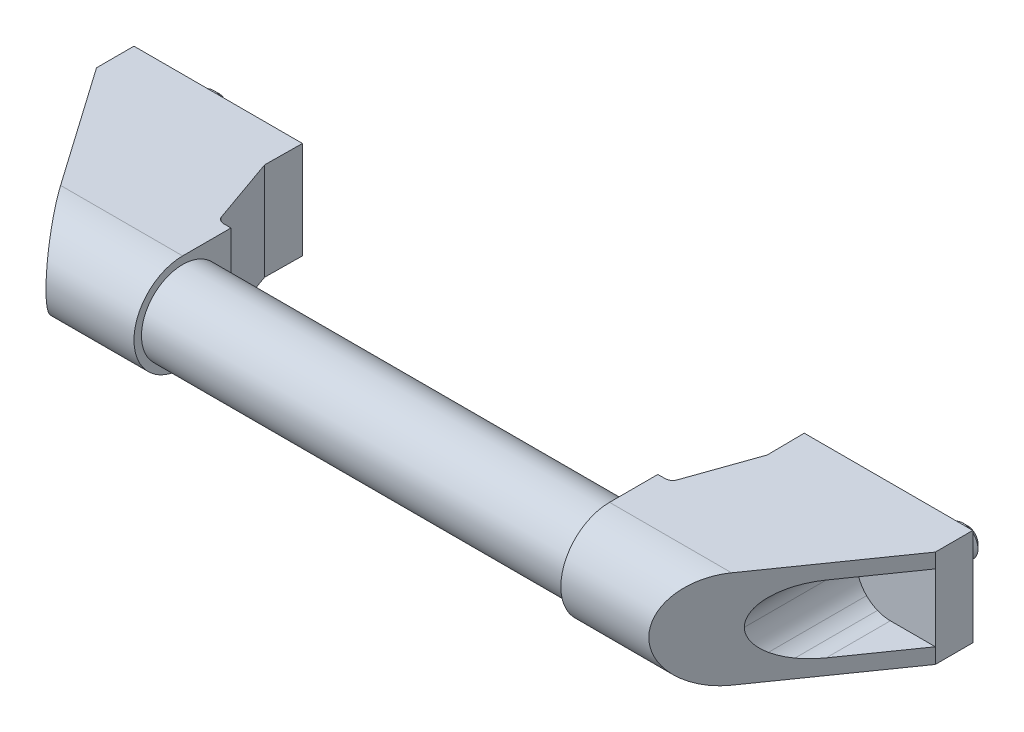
ISO-10303-21;
HEADER;
FILE_DESCRIPTION(('STEP AP214'),'2;1');
FILE_NAME('part.step','',(''),(''),'','','');
FILE_SCHEMA(('AUTOMOTIVE_DESIGN { 1 0 10303 214 1 1 1 1 }'));
ENDSEC;
DATA;
#1=APPLICATION_CONTEXT('core data for automotive mechanical design processes');
#2=APPLICATION_PROTOCOL_DEFINITION('international standard','automotive_design',2000,#1);
#3=PRODUCT_CONTEXT('',#1,'mechanical');
#4=PRODUCT('Part','Part','',(#3));
#5=PRODUCT_RELATED_PRODUCT_CATEGORY('part','',(#4));
#6=PRODUCT_DEFINITION_FORMATION('','',#4);
#7=PRODUCT_DEFINITION_CONTEXT('part definition',#1,'design');
#8=PRODUCT_DEFINITION('design','',#6,#7);
#9=PRODUCT_DEFINITION_SHAPE('','',#8);
#10=(LENGTH_UNIT() NAMED_UNIT(*) SI_UNIT(.MILLI.,.METRE.));
#11=(NAMED_UNIT(*) PLANE_ANGLE_UNIT() SI_UNIT($,.RADIAN.));
#12=(NAMED_UNIT(*) SI_UNIT($,.STERADIAN.) SOLID_ANGLE_UNIT());
#13=UNCERTAINTY_MEASURE_WITH_UNIT(LENGTH_MEASURE(1.E-05),#10,'distance_accuracy_value','');
#14=(GEOMETRIC_REPRESENTATION_CONTEXT(3) GLOBAL_UNCERTAINTY_ASSIGNED_CONTEXT((#13)) GLOBAL_UNIT_ASSIGNED_CONTEXT((#10,
#11,#12)) REPRESENTATION_CONTEXT('',''));
#15=CARTESIAN_POINT('',(0.,0.,0.));
#16=DIRECTION('',(0.,0.,1.));
#17=DIRECTION('',(1.,0.,0.));
#18=AXIS2_PLACEMENT_3D('',#15,#16,#17);
#19=CARTESIAN_POINT('',(157.,0.,42.));
#20=DIRECTION('',(1.,0.,0.));
#21=DIRECTION('',(0.,1.,0.));
#22=AXIS2_PLACEMENT_3D('',#19,#20,#21);
#23=PLANE('',#22);
#24=DIRECTION('',(0.,0.,-1.));
#25=VECTOR('',#24,1.);
#26=CARTESIAN_POINT('',(157.,13.,42.));
#27=LINE('',#26,#25);
#28=CARTESIAN_POINT('',(157.,13.,42.));
#29=VERTEX_POINT('',#28);
#30=CARTESIAN_POINT('',(157.,13.,29.1064296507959));
#31=VERTEX_POINT('',#30);
#32=EDGE_CURVE('E609',#29,#31,#27,.T.);
#33=ORIENTED_EDGE('',*,*,#32,.T.);
#34=DIRECTION('',(0.,1.,0.));
#35=VECTOR('',#34,1.);
#36=CARTESIAN_POINT('',(157.,-13.,29.1064296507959));
#37=LINE('',#36,#35);
#38=CARTESIAN_POINT('',(157.,-13.,29.1064296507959));
#39=VERTEX_POINT('',#38);
#40=EDGE_CURVE('E586',#39,#31,#37,.T.);
#41=ORIENTED_EDGE('',*,*,#40,.F.);
#42=DIRECTION('',(0.,0.,-1.));
#43=VECTOR('',#42,1.);
#44=CARTESIAN_POINT('',(157.,-13.,42.));
#45=LINE('',#44,#43);
#46=CARTESIAN_POINT('',(157.,-13.,42.));
#47=VERTEX_POINT('',#46);
#48=EDGE_CURVE('E612',#47,#39,#45,.T.);
#49=ORIENTED_EDGE('',*,*,#48,.F.);
#50=CARTESIAN_POINT('',(157.,0.,42.));
#51=DIRECTION('',(1.,0.,0.));
#52=DIRECTION('',(0.,1.,0.));
#53=AXIS2_PLACEMENT_3D('',#50,#51,#52);
#54=CIRCLE('',#53,13.);
#55=EDGE_CURVE('E615',#29,#47,#54,.T.);
#56=ORIENTED_EDGE('',*,*,#55,.F.);
#57=EDGE_LOOP('',(#33,#41,#49,#56));
#58=FACE_BOUND('',#57,.T.);
#59=CARTESIAN_POINT('',(157.,0.,42.));
#60=DIRECTION('',(1.,0.,0.));
#61=DIRECTION('',(0.,1.,0.));
#62=AXIS2_PLACEMENT_3D('',#59,#60,#61);
#63=CIRCLE('',#62,11.);
#64=CARTESIAN_POINT('',(157.,11.,42.));
#65=VERTEX_POINT('',#64);
#66=EDGE_CURVE('E9',#65,#65,#63,.F.);
#67=ORIENTED_EDGE('',*,*,#66,.F.);
#68=EDGE_LOOP('',(#67));
#69=FACE_BOUND('',#68,.T.);
#70=ADVANCED_FACE('F14',(#58,#69),#23,.F.);
#71=CARTESIAN_POINT('',(212.,13.,0.));
#72=DIRECTION('',(0.,0.,-1.));
#73=DIRECTION('',(-1.,0.,0.));
#74=AXIS2_PLACEMENT_3D('',#71,#72,#73);
#75=PLANE('',#74);
#76=DIRECTION('',(0.,-1.,0.));
#77=VECTOR('',#76,1.);
#78=CARTESIAN_POINT('',(187.,8.,0.));
#79=LINE('',#78,#77);
#80=CARTESIAN_POINT('',(187.,8.,0.));
#81=VERTEX_POINT('',#80);
#82=CARTESIAN_POINT('',(187.,-8.,0.));
#83=VERTEX_POINT('',#82);
#84=EDGE_CURVE('E496',#81,#83,#79,.T.);
#85=ORIENTED_EDGE('',*,*,#84,.F.);
#86=DIRECTION('',(-1.,0.,0.));
#87=VECTOR('',#86,1.);
#88=CARTESIAN_POINT('',(187.,8.,0.));
#89=LINE('',#88,#87);
#90=CARTESIAN_POINT('',(172.,8.,0.));
#91=VERTEX_POINT('',#90);
#92=EDGE_CURVE('E29',#81,#91,#89,.T.);
#93=ORIENTED_EDGE('',*,*,#92,.T.);
#94=DIRECTION('',(0.,1.,0.));
#95=VECTOR('',#94,1.);
#96=CARTESIAN_POINT('',(172.,-8.,0.));
#97=LINE('',#96,#95);
#98=CARTESIAN_POINT('',(172.,-8.,0.));
#99=VERTEX_POINT('',#98);
#100=EDGE_CURVE('E490',#99,#91,#97,.T.);
#101=ORIENTED_EDGE('',*,*,#100,.F.);
#102=DIRECTION('',(1.,0.,0.));
#103=VECTOR('',#102,1.);
#104=CARTESIAN_POINT('',(172.,-8.,0.));
#105=LINE('',#104,#103);
#106=EDGE_CURVE('E493',#99,#83,#105,.T.);
#107=ORIENTED_EDGE('',*,*,#106,.T.);
#108=EDGE_LOOP('',(#85,#93,#101,#107));
#109=FACE_BOUND('',#108,.T.);
#110=DIRECTION('',(0.,1.,0.));
#111=VECTOR('',#110,1.);
#112=CARTESIAN_POINT('',(167.,-13.,0.));
#113=LINE('',#112,#111);
#114=CARTESIAN_POINT('',(167.,-13.,0.));
#115=VERTEX_POINT('',#114);
#116=CARTESIAN_POINT('',(167.,13.,0.));
#117=VERTEX_POINT('',#116);
#118=EDGE_CURVE('E594',#115,#117,#113,.T.);
#119=ORIENTED_EDGE('',*,*,#118,.T.);
#120=DIRECTION('',(-1.,0.,0.));
#121=VECTOR('',#120,1.);
#122=CARTESIAN_POINT('',(212.,13.,0.));
#123=LINE('',#122,#121);
#124=CARTESIAN_POINT('',(212.,13.,0.));
#125=VERTEX_POINT('',#124);
#126=EDGE_CURVE('E625',#125,#117,#123,.T.);
#127=ORIENTED_EDGE('',*,*,#126,.F.);
#128=DIRECTION('',(0.,-1.,0.));
#129=VECTOR('',#128,1.);
#130=CARTESIAN_POINT('',(212.,13.,0.));
#131=LINE('',#130,#129);
#132=CARTESIAN_POINT('',(212.,-13.,0.));
#133=VERTEX_POINT('',#132);
#134=EDGE_CURVE('E620',#125,#133,#131,.T.);
#135=ORIENTED_EDGE('',*,*,#134,.T.);
#136=DIRECTION('',(-1.,0.,0.));
#137=VECTOR('',#136,1.);
#138=CARTESIAN_POINT('',(212.,-13.,0.));
#139=LINE('',#138,#137);
#140=EDGE_CURVE('E628',#133,#115,#139,.T.);
#141=ORIENTED_EDGE('',*,*,#140,.T.);
#142=EDGE_LOOP('',(#119,#127,#135,#141));
#143=FACE_BOUND('',#142,.T.);
#144=CARTESIAN_POINT('',(200.,0.,0.));
#145=DIRECTION('',(0.,0.,1.));
#146=DIRECTION('',(1.,0.,0.));
#147=AXIS2_PLACEMENT_3D('',#144,#145,#146);
#148=CIRCLE('',#147,4.);
#149=CARTESIAN_POINT('',(204.,0.,0.));
#150=VERTEX_POINT('',#149);
#151=EDGE_CURVE('E480',#150,#150,#148,.T.);
#152=ORIENTED_EDGE('',*,*,#151,.T.);
#153=EDGE_LOOP('',(#152));
#154=FACE_BOUND('',#153,.T.);
#155=ADVANCED_FACE('F693',(#109,#143,#154),#75,.T.);
#156=CARTESIAN_POINT('',(212.,-13.,10.));
#157=DIRECTION('',(-0.819152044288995,0.,-0.573576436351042));
#158=DIRECTION('',(-0.573576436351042,0.,0.819152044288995));
#159=AXIS2_PLACEMENT_3D('',#156,#157,#158);
#160=PLANE('',#159);
#161=DIRECTION('',(0.573576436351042,0.,-0.819152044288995));
#162=VECTOR('',#161,1.);
#163=CARTESIAN_POINT('',(212.,-8.90119415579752,10.));
#164=LINE('',#163,#162);
#165=CARTESIAN_POINT('',(199.999992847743,-8.90119415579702,27.1377862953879));
#166=VERTEX_POINT('',#165);
#167=CARTESIAN_POINT('',(212.,-8.90119415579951,10.));
#168=VERTEX_POINT('',#167);
#169=EDGE_CURVE('E22',#166,#168,#164,.T.);
#170=ORIENTED_EDGE('',*,*,#169,.F.);
#171=CARTESIAN_POINT('',(199.999999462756,0.0988421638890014,27.1377768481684));
#172=DIRECTION('',(-0.819152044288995,0.,-0.573576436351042));
#173=DIRECTION('',(-0.573576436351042,0.,0.819152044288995));
#174=AXIS2_PLACEMENT_3D('',#171,#172,#173);
#175=ELLIPSE('',#174,15.6910844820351,9.00003631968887);
#176=CARTESIAN_POINT('',(196.555841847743,-8.21611015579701,32.0565436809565));
#177=VERTEX_POINT('',#176);
#178=EDGE_CURVE('E653',#166,#177,#175,.T.);
#179=ORIENTED_EDGE('',*,*,#178,.T.);
#180=CARTESIAN_POINT('',(200.000013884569,0.0988360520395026,27.1377562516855));
#181=DIRECTION('',(-0.819152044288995,0.,-0.573576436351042));
#182=DIRECTION('',(-0.573576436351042,0.,0.819152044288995));
#183=AXIS2_PLACEMENT_3D('',#180,#181,#182);
#184=ELLIPSE('',#183,15.6910842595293,9.00003619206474);
#185=CARTESIAN_POINT('',(193.636031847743,-6.26515515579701,36.2264645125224));
#186=VERTEX_POINT('',#185);
#187=EDGE_CURVE('E650',#177,#186,#184,.T.);
#188=ORIENTED_EDGE('',*,*,#187,.T.);
#189=CARTESIAN_POINT('',(200.000032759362,0.0988180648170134,27.1377292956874));
#190=DIRECTION('',(-0.819152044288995,0.,-0.573576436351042));
#191=DIRECTION('',(-0.573576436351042,0.,0.819152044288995));
#192=AXIS2_PLACEMENT_3D('',#189,#190,#191);
#193=ELLIPSE('',#192,15.6910853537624,9.00003681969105);
#194=CARTESIAN_POINT('',(190.999995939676,0.0988089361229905,39.9911139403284));
#195=VERTEX_POINT('',#194);
#196=EDGE_CURVE('E647',#186,#195,#193,.T.);
#197=ORIENTED_EDGE('',*,*,#196,.T.);
#198=CARTESIAN_POINT('',(200.000030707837,0.098790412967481,27.1377322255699));
#199=DIRECTION('',(-0.819152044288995,0.,-0.573576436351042));
#200=DIRECTION('',(-0.573576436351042,0.,0.819152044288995));
#201=AXIS2_PLACEMENT_3D('',#198,#199,#200);
#202=ELLIPSE('',#201,15.6910817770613,9.00003476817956);
#203=CARTESIAN_POINT('',(193.636039,6.4627699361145,36.2264542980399));
#204=VERTEX_POINT('',#203);
#205=EDGE_CURVE('E644',#195,#204,#202,.T.);
#206=ORIENTED_EDGE('',*,*,#205,.T.);
#207=CARTESIAN_POINT('',(200.000021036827,0.0987787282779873,27.1377460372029));
#208=DIRECTION('',(-0.819152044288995,0.,-0.573576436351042));
#209=DIRECTION('',(-0.573576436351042,0.,0.819152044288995));
#210=AXIS2_PLACEMENT_3D('',#207,#208,#209);
#211=ELLIPSE('',#210,15.6910842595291,9.00003619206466);
#212=CARTESIAN_POINT('',(196.555849,8.4137249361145,32.0565334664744));
#213=VERTEX_POINT('',#212);
#214=EDGE_CURVE('E641',#204,#213,#211,.T.);
#215=ORIENTED_EDGE('',*,*,#214,.T.);
#216=CARTESIAN_POINT('',(200.000006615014,0.098772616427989,27.1377666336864));
#217=DIRECTION('',(-0.819152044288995,0.,-0.573576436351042));
#218=DIRECTION('',(-0.573576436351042,0.,0.819152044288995));
#219=AXIS2_PLACEMENT_3D('',#216,#217,#218);
#220=ELLIPSE('',#219,15.691084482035,9.0000363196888);
#221=CARTESIAN_POINT('',(200.,9.09880893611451,27.1377760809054));
#222=VERTEX_POINT('',#221);
#223=EDGE_CURVE('E638',#213,#222,#220,.T.);
#224=ORIENTED_EDGE('',*,*,#223,.T.);
#225=DIRECTION('',(0.573576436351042,0.,-0.819152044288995));
#226=VECTOR('',#225,1.);
#227=CARTESIAN_POINT('',(212.,9.09880893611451,10.));
#228=LINE('',#227,#226);
#229=CARTESIAN_POINT('',(212.,9.09880893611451,10.));
#230=VERTEX_POINT('',#229);
#231=EDGE_CURVE('E635',#222,#230,#228,.T.);
#232=ORIENTED_EDGE('',*,*,#231,.T.);
#233=DIRECTION('',(0.,1.,0.));
#234=VECTOR('',#233,1.);
#235=CARTESIAN_POINT('',(212.,-13.,10.));
#236=LINE('',#235,#234);
#237=CARTESIAN_POINT('',(212.,13.,10.));
#238=VERTEX_POINT('',#237);
#239=EDGE_CURVE('E603',#230,#238,#236,.T.);
#240=ORIENTED_EDGE('',*,*,#239,.T.);
#241=DIRECTION('',(-0.573576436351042,0.,0.819152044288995));
#242=VECTOR('',#241,1.);
#243=CARTESIAN_POINT('',(212.,13.,10.));
#244=LINE('',#243,#242);
#245=CARTESIAN_POINT('',(189.593358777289,13.,42.));
#246=VERTEX_POINT('',#245);
#247=EDGE_CURVE('E597',#238,#246,#244,.T.);
#248=ORIENTED_EDGE('',*,*,#247,.T.);
#249=CARTESIAN_POINT('',(189.593358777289,0.,42.));
#250=DIRECTION('',(-0.819152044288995,0.,-0.573576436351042));
#251=DIRECTION('',(-0.573576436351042,0.,0.819152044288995));
#252=AXIS2_PLACEMENT_3D('',#249,#250,#251);
#253=ELLIPSE('',#252,15.8700696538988,13.);
#254=CARTESIAN_POINT('',(189.593358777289,-13.,42.));
#255=VERTEX_POINT('',#254);
#256=EDGE_CURVE('E607',#255,#246,#253,.T.);
#257=ORIENTED_EDGE('',*,*,#256,.F.);
#258=DIRECTION('',(-0.573576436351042,0.,0.819152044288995));
#259=VECTOR('',#258,1.);
#260=CARTESIAN_POINT('',(212.,-13.,10.));
#261=LINE('',#260,#259);
#262=CARTESIAN_POINT('',(212.,-13.,10.));
#263=VERTEX_POINT('',#262);
#264=EDGE_CURVE('E600',#263,#255,#261,.T.);
#265=ORIENTED_EDGE('',*,*,#264,.F.);
#266=EDGE_CURVE('E604',#263,#168,#236,.T.);
#267=ORIENTED_EDGE('',*,*,#266,.T.);
#268=EDGE_LOOP('',(#170,#179,#188,#197,#206,#215,#224,#232,#240,#248,#257,#265,#267));
#269=FACE_BOUND('',#268,.T.);
#270=ADVANCED_FACE('F666',(#269),#160,.F.);
#271=CARTESIAN_POINT('',(212.,13.,42.));
#272=DIRECTION('',(0.,1.,0.));
#273=DIRECTION('',(-1.,0.,0.));
#274=AXIS2_PLACEMENT_3D('',#271,#272,#273);
#275=PLANE('',#274);
#276=DIRECTION('',(-0.0104830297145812,0.,-0.999945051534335));
#277=VECTOR('',#276,1.);
#278=CARTESIAN_POINT('',(167.104830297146,13.,9.9994505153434));
#279=LINE('',#278,#277);
#280=CARTESIAN_POINT('',(167.104830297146,13.,9.9994505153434));
#281=VERTEX_POINT('',#280);
#282=EDGE_CURVE('E572',#281,#117,#279,.T.);
#283=ORIENTED_EDGE('',*,*,#282,.F.);
#284=DIRECTION('',(-0.332150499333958,0.,0.943226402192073));
#285=VECTOR('',#284,1.);
#286=CARTESIAN_POINT('',(167.104830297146,13.,9.9994505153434));
#287=LINE('',#286,#285);
#288=CARTESIAN_POINT('',(160.854102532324,13.,27.7499927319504));
#289=VERTEX_POINT('',#288);
#290=EDGE_CURVE('E569',#281,#289,#287,.T.);
#291=ORIENTED_EDGE('',*,*,#290,.T.);
#292=CARTESIAN_POINT('',(158.967649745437,13.,27.085691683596));
#293=DIRECTION('',(0.,1.,0.));
#294=DIRECTION('',(-1.,0.,0.));
#295=AXIS2_PLACEMENT_3D('',#292,#293,#294);
#296=CIRCLE('',#295,2.);
#297=CARTESIAN_POINT('',(158.988615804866,13.,29.0855817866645));
#298=VERTEX_POINT('',#297);
#299=EDGE_CURVE('E566',#298,#289,#296,.T.);
#300=ORIENTED_EDGE('',*,*,#299,.F.);
#301=DIRECTION('',(0.999945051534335,0.,-0.0104830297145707));
#302=VECTOR('',#301,1.);
#303=CARTESIAN_POINT('',(157.,13.,29.1064296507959));
#304=LINE('',#303,#302);
#305=EDGE_CURVE('E563',#31,#298,#304,.T.);
#306=ORIENTED_EDGE('',*,*,#305,.F.);
#307=ORIENTED_EDGE('',*,*,#32,.F.);
#308=DIRECTION('',(-1.,0.,0.));
#309=VECTOR('',#308,1.);
#310=CARTESIAN_POINT('',(212.,13.,42.));
#311=LINE('',#310,#309);
#312=EDGE_CURVE('E633',#246,#29,#311,.T.);
#313=ORIENTED_EDGE('',*,*,#312,.F.);
#314=ORIENTED_EDGE('',*,*,#247,.F.);
#315=DIRECTION('',(0.,0.,-1.));
#316=VECTOR('',#315,1.);
#317=CARTESIAN_POINT('',(212.,13.,42.));
#318=LINE('',#317,#316);
#319=EDGE_CURVE('E618',#238,#125,#318,.T.);
#320=ORIENTED_EDGE('',*,*,#319,.T.);
#321=ORIENTED_EDGE('',*,*,#126,.T.);
#322=EDGE_LOOP('',(#283,#291,#300,#306,#307,#313,#314,#320,#321));
#323=FACE_BOUND('',#322,.T.);
#324=ADVANCED_FACE('F700',(#323),#275,.T.);
#325=CARTESIAN_POINT('',(212.,0.,42.));
#326=DIRECTION('',(-1.,0.,0.));
#327=DIRECTION('',(0.,-1.,0.));
#328=AXIS2_PLACEMENT_3D('',#325,#326,#327);
#329=CYLINDRICAL_SURFACE('',#328,13.);
#330=ORIENTED_EDGE('',*,*,#256,.T.);
#331=ORIENTED_EDGE('',*,*,#312,.T.);
#332=ORIENTED_EDGE('',*,*,#55,.T.);
#333=DIRECTION('',(-1.,0.,0.));
#334=VECTOR('',#333,1.);
#335=CARTESIAN_POINT('',(212.,-13.,42.));
#336=LINE('',#335,#334);
#337=EDGE_CURVE('E631',#255,#47,#336,.T.);
#338=ORIENTED_EDGE('',*,*,#337,.F.);
#339=EDGE_LOOP('',(#330,#331,#332,#338));
#340=FACE_BOUND('',#339,.T.);
#341=ADVANCED_FACE('F16',(#340),#329,.T.);
#342=CARTESIAN_POINT('',(212.,-13.,42.));
#343=DIRECTION('',(0.,1.,0.));
#344=DIRECTION('',(-1.,0.,0.));
#345=AXIS2_PLACEMENT_3D('',#342,#343,#344);
#346=PLANE('',#345);
#347=DIRECTION('',(-0.332150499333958,0.,0.943226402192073));
#348=VECTOR('',#347,1.);
#349=CARTESIAN_POINT('',(167.104830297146,-13.,9.9994505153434));
#350=LINE('',#349,#348);
#351=CARTESIAN_POINT('',(167.104830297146,-13.,9.9994505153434));
#352=VERTEX_POINT('',#351);
#353=CARTESIAN_POINT('',(160.854102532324,-13.,27.7499927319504));
#354=VERTEX_POINT('',#353);
#355=EDGE_CURVE('E580',#352,#354,#350,.T.);
#356=ORIENTED_EDGE('',*,*,#355,.F.);
#357=DIRECTION('',(-0.0104830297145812,0.,-0.999945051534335));
#358=VECTOR('',#357,1.);
#359=CARTESIAN_POINT('',(167.104830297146,-13.,9.9994505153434));
#360=LINE('',#359,#358);
#361=EDGE_CURVE('E583',#352,#115,#360,.T.);
#362=ORIENTED_EDGE('',*,*,#361,.T.);
#363=ORIENTED_EDGE('',*,*,#140,.F.);
#364=DIRECTION('',(0.,0.,-1.));
#365=VECTOR('',#364,1.);
#366=CARTESIAN_POINT('',(212.,-13.,42.));
#367=LINE('',#366,#365);
#368=EDGE_CURVE('E623',#263,#133,#367,.T.);
#369=ORIENTED_EDGE('',*,*,#368,.F.);
#370=ORIENTED_EDGE('',*,*,#264,.T.);
#371=ORIENTED_EDGE('',*,*,#337,.T.);
#372=ORIENTED_EDGE('',*,*,#48,.T.);
#373=DIRECTION('',(0.999945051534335,0.,-0.0104830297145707));
#374=VECTOR('',#373,1.);
#375=CARTESIAN_POINT('',(157.,-13.,29.1064296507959));
#376=LINE('',#375,#374);
#377=CARTESIAN_POINT('',(158.988615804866,-13.,29.0855817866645));
#378=VERTEX_POINT('',#377);
#379=EDGE_CURVE('E574',#39,#378,#376,.T.);
#380=ORIENTED_EDGE('',*,*,#379,.T.);
#381=CARTESIAN_POINT('',(158.967649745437,-13.,27.085691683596));
#382=DIRECTION('',(0.,1.,0.));
#383=DIRECTION('',(-1.,0.,0.));
#384=AXIS2_PLACEMENT_3D('',#381,#382,#383);
#385=CIRCLE('',#384,2.);
#386=EDGE_CURVE('E577',#378,#354,#385,.T.);
#387=ORIENTED_EDGE('',*,*,#386,.T.);
#388=EDGE_LOOP('',(#356,#362,#363,#369,#370,#371,#372,#380,#387));
#389=FACE_BOUND('',#388,.T.);
#390=ADVANCED_FACE('F670',(#389),#346,.F.);
#391=CARTESIAN_POINT('',(212.,0.,42.));
#392=DIRECTION('',(1.,0.,0.));
#393=DIRECTION('',(0.,1.,0.));
#394=AXIS2_PLACEMENT_3D('',#391,#392,#393);
#395=PLANE('',#394);
#396=ORIENTED_EDGE('',*,*,#266,.F.);
#397=ORIENTED_EDGE('',*,*,#368,.T.);
#398=ORIENTED_EDGE('',*,*,#134,.F.);
#399=ORIENTED_EDGE('',*,*,#319,.F.);
#400=ORIENTED_EDGE('',*,*,#239,.F.);
#401=DIRECTION('',(0.,1.,0.));
#402=VECTOR('',#401,1.);
#403=CARTESIAN_POINT('',(212.,-8.90119415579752,10.));
#404=LINE('',#403,#402);
#405=EDGE_CURVE('E540',#168,#230,#404,.T.);
#406=ORIENTED_EDGE('',*,*,#405,.F.);
#407=EDGE_LOOP('',(#396,#397,#398,#399,#400,#406));
#408=FACE_BOUND('',#407,.T.);
#409=ADVANCED_FACE('F663',(#408),#395,.T.);
#410=CARTESIAN_POINT('',(167.104830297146,-13.,9.9994505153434));
#411=DIRECTION('',(0.999945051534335,0.,-0.0104830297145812));
#412=DIRECTION('',(-0.0104830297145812,0.,-0.999945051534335));
#413=AXIS2_PLACEMENT_3D('',#410,#411,#412);
#414=PLANE('',#413);
#415=DIRECTION('',(0.,1.,0.));
#416=VECTOR('',#415,1.);
#417=CARTESIAN_POINT('',(167.104830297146,-13.,9.9994505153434));
#418=LINE('',#417,#416);
#419=EDGE_CURVE('E592',#352,#281,#418,.T.);
#420=ORIENTED_EDGE('',*,*,#419,.T.);
#421=ORIENTED_EDGE('',*,*,#282,.T.);
#422=ORIENTED_EDGE('',*,*,#118,.F.);
#423=ORIENTED_EDGE('',*,*,#361,.F.);
#424=EDGE_LOOP('',(#420,#421,#422,#423));
#425=FACE_BOUND('',#424,.T.);
#426=ADVANCED_FACE('F735',(#425),#414,.F.);
#427=CARTESIAN_POINT('',(167.104830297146,-13.,9.9994505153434));
#428=DIRECTION('',(-0.943226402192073,0.,-0.332150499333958));
#429=DIRECTION('',(-0.332150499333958,0.,0.943226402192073));
#430=AXIS2_PLACEMENT_3D('',#427,#428,#429);
#431=PLANE('',#430);
#432=DIRECTION('',(0.,1.,0.));
#433=VECTOR('',#432,1.);
#434=CARTESIAN_POINT('',(160.854102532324,-13.,27.7499927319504));
#435=LINE('',#434,#433);
#436=EDGE_CURVE('E590',#354,#289,#435,.T.);
#437=ORIENTED_EDGE('',*,*,#436,.T.);
#438=ORIENTED_EDGE('',*,*,#290,.F.);
#439=ORIENTED_EDGE('',*,*,#419,.F.);
#440=ORIENTED_EDGE('',*,*,#355,.T.);
#441=EDGE_LOOP('',(#437,#438,#439,#440));
#442=FACE_BOUND('',#441,.T.);
#443=ADVANCED_FACE('F689',(#442),#431,.T.);
#444=CARTESIAN_POINT('',(158.967649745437,-13.,27.085691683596));
#445=DIRECTION('',(0.,1.,0.));
#446=DIRECTION('',(-1.,0.,0.));
#447=AXIS2_PLACEMENT_3D('',#444,#445,#446);
#448=CYLINDRICAL_SURFACE('',#447,2.);
#449=DIRECTION('',(0.,1.,0.));
#450=VECTOR('',#449,1.);
#451=CARTESIAN_POINT('',(158.988615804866,-13.,29.0855817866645));
#452=LINE('',#451,#450);
#453=EDGE_CURVE('E588',#378,#298,#452,.T.);
#454=ORIENTED_EDGE('',*,*,#453,.T.);
#455=ORIENTED_EDGE('',*,*,#299,.T.);
#456=ORIENTED_EDGE('',*,*,#436,.F.);
#457=ORIENTED_EDGE('',*,*,#386,.F.);
#458=EDGE_LOOP('',(#454,#455,#456,#457));
#459=FACE_BOUND('',#458,.T.);
#460=ADVANCED_FACE('F686',(#459),#448,.F.);
#461=CARTESIAN_POINT('',(157.,-13.,29.1064296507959));
#462=DIRECTION('',(0.0104830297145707,0.,0.999945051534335));
#463=DIRECTION('',(0.999945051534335,0.,-0.0104830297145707));
#464=AXIS2_PLACEMENT_3D('',#461,#462,#463);
#465=PLANE('',#464);
#466=ORIENTED_EDGE('',*,*,#40,.T.);
#467=ORIENTED_EDGE('',*,*,#305,.T.);
#468=ORIENTED_EDGE('',*,*,#453,.F.);
#469=ORIENTED_EDGE('',*,*,#379,.F.);
#470=EDGE_LOOP('',(#466,#467,#468,#469));
#471=FACE_BOUND('',#470,.T.);
#472=ADVANCED_FACE('F682',(#471),#465,.F.);
#473=CARTESIAN_POINT('',(212.,-8.90119415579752,10.));
#474=DIRECTION('',(0.,1.,0.));
#475=DIRECTION('',(-1.,0.,0.));
#476=AXIS2_PLACEMENT_3D('',#473,#474,#475);
#477=PLANE('',#476);
#478=ORIENTED_EDGE('',*,*,#169,.T.);
#479=DIRECTION('',(-1.,0.,0.));
#480=VECTOR('',#479,1.);
#481=CARTESIAN_POINT('',(212.,-8.90119415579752,10.));
#482=LINE('',#481,#480);
#483=CARTESIAN_POINT('',(199.999992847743,-8.90119415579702,10.));
#484=VERTEX_POINT('',#483);
#485=EDGE_CURVE('E37',#168,#484,#482,.T.);
#486=ORIENTED_EDGE('',*,*,#485,.T.);
#487=DIRECTION('',(0.,0.,1.));
#488=VECTOR('',#487,1.);
#489=CARTESIAN_POINT('',(199.999992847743,-8.90119415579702,10.));
#490=LINE('',#489,#488);
#491=EDGE_CURVE('E560',#484,#166,#490,.T.);
#492=ORIENTED_EDGE('',*,*,#491,.T.);
#493=EDGE_LOOP('',(#478,#486,#492));
#494=FACE_BOUND('',#493,.T.);
#495=ADVANCED_FACE('F658',(#494),#477,.T.);
#496=CARTESIAN_POINT('',(199.999999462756,0.0988421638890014,10.));
#497=DIRECTION('',(0.,0.,1.));
#498=DIRECTION('',(1.,0.,0.));
#499=AXIS2_PLACEMENT_3D('',#496,#497,#498);
#500=CYLINDRICAL_SURFACE('',#499,9.00003631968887);
#501=ORIENTED_EDGE('',*,*,#491,.F.);
#502=CARTESIAN_POINT('',(199.999999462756,0.0988421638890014,10.));
#503=DIRECTION('',(0.,0.,1.));
#504=DIRECTION('',(1.,0.,0.));
#505=AXIS2_PLACEMENT_3D('',#502,#503,#504);
#506=CIRCLE('',#505,9.00003631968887);
#507=CARTESIAN_POINT('',(196.555841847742,-8.21611015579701,10.));
#508=VERTEX_POINT('',#507);
#509=EDGE_CURVE('E520',#508,#484,#506,.T.);
#510=ORIENTED_EDGE('',*,*,#509,.F.);
#511=DIRECTION('',(0.,0.,1.));
#512=VECTOR('',#511,1.);
#513=CARTESIAN_POINT('',(196.555841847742,-8.21611015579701,10.));
#514=LINE('',#513,#512);
#515=EDGE_CURVE('E557',#508,#177,#514,.T.);
#516=ORIENTED_EDGE('',*,*,#515,.T.);
#517=ORIENTED_EDGE('',*,*,#178,.F.);
#518=EDGE_LOOP('',(#501,#510,#516,#517));
#519=FACE_BOUND('',#518,.T.);
#520=ADVANCED_FACE('F812',(#519),#500,.F.);
#521=CARTESIAN_POINT('',(200.000013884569,0.0988360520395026,10.));
#522=DIRECTION('',(0.,0.,1.));
#523=DIRECTION('',(1.,0.,0.));
#524=AXIS2_PLACEMENT_3D('',#521,#522,#523);
#525=CYLINDRICAL_SURFACE('',#524,9.00003619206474);
#526=ORIENTED_EDGE('',*,*,#515,.F.);
#527=CARTESIAN_POINT('',(200.000013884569,0.0988360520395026,10.));
#528=DIRECTION('',(0.,0.,1.));
#529=DIRECTION('',(1.,0.,0.));
#530=AXIS2_PLACEMENT_3D('',#527,#528,#529);
#531=CIRCLE('',#530,9.00003619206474);
#532=CARTESIAN_POINT('',(193.636031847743,-6.26515515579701,10.));
#533=VERTEX_POINT('',#532);
#534=EDGE_CURVE('E522',#533,#508,#531,.T.);
#535=ORIENTED_EDGE('',*,*,#534,.F.);
#536=DIRECTION('',(0.,0.,1.));
#537=VECTOR('',#536,1.);
#538=CARTESIAN_POINT('',(193.636031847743,-6.26515515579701,10.));
#539=LINE('',#538,#537);
#540=EDGE_CURVE('E554',#533,#186,#539,.T.);
#541=ORIENTED_EDGE('',*,*,#540,.T.);
#542=ORIENTED_EDGE('',*,*,#187,.F.);
#543=EDGE_LOOP('',(#526,#535,#541,#542));
#544=FACE_BOUND('',#543,.T.);
#545=ADVANCED_FACE('F819',(#544),#525,.F.);
#546=CARTESIAN_POINT('',(200.000032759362,0.0988180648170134,10.));
#547=DIRECTION('',(0.,0.,1.));
#548=DIRECTION('',(1.,0.,0.));
#549=AXIS2_PLACEMENT_3D('',#546,#547,#548);
#550=CYLINDRICAL_SURFACE('',#549,9.00003681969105);
#551=ORIENTED_EDGE('',*,*,#540,.F.);
#552=CARTESIAN_POINT('',(200.000032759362,0.0988180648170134,10.));
#553=DIRECTION('',(0.,0.,1.));
#554=DIRECTION('',(1.,0.,0.));
#555=AXIS2_PLACEMENT_3D('',#552,#553,#554);
#556=CIRCLE('',#555,9.00003681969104);
#557=CARTESIAN_POINT('',(190.999995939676,0.0988089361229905,10.));
#558=VERTEX_POINT('',#557);
#559=EDGE_CURVE('E525',#558,#533,#556,.T.);
#560=ORIENTED_EDGE('',*,*,#559,.F.);
#561=DIRECTION('',(0.,0.,1.));
#562=VECTOR('',#561,1.);
#563=CARTESIAN_POINT('',(190.999995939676,0.0988089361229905,10.));
#564=LINE('',#563,#562);
#565=EDGE_CURVE('E551',#558,#195,#564,.T.);
#566=ORIENTED_EDGE('',*,*,#565,.T.);
#567=ORIENTED_EDGE('',*,*,#196,.F.);
#568=EDGE_LOOP('',(#551,#560,#566,#567));
#569=FACE_BOUND('',#568,.T.);
#570=ADVANCED_FACE('F828',(#569),#550,.F.);
#571=CARTESIAN_POINT('',(200.000030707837,0.098790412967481,10.));
#572=DIRECTION('',(0.,0.,1.));
#573=DIRECTION('',(1.,0.,0.));
#574=AXIS2_PLACEMENT_3D('',#571,#572,#573);
#575=CYLINDRICAL_SURFACE('',#574,9.00003476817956);
#576=ORIENTED_EDGE('',*,*,#565,.F.);
#577=CARTESIAN_POINT('',(200.000030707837,0.098790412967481,10.));
#578=DIRECTION('',(0.,0.,1.));
#579=DIRECTION('',(1.,0.,0.));
#580=AXIS2_PLACEMENT_3D('',#577,#578,#579);
#581=CIRCLE('',#580,9.00003476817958);
#582=CARTESIAN_POINT('',(193.636039,6.4627699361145,10.));
#583=VERTEX_POINT('',#582);
#584=EDGE_CURVE('E528',#583,#558,#581,.T.);
#585=ORIENTED_EDGE('',*,*,#584,.F.);
#586=DIRECTION('',(0.,0.,1.));
#587=VECTOR('',#586,1.);
#588=CARTESIAN_POINT('',(193.636039,6.4627699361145,10.));
#589=LINE('',#588,#587);
#590=EDGE_CURVE('E548',#583,#204,#589,.T.);
#591=ORIENTED_EDGE('',*,*,#590,.T.);
#592=ORIENTED_EDGE('',*,*,#205,.F.);
#593=EDGE_LOOP('',(#576,#585,#591,#592));
#594=FACE_BOUND('',#593,.T.);
#595=ADVANCED_FACE('F837',(#594),#575,.F.);
#596=CARTESIAN_POINT('',(200.000021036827,0.0987787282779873,10.));
#597=DIRECTION('',(0.,0.,1.));
#598=DIRECTION('',(1.,0.,0.));
#599=AXIS2_PLACEMENT_3D('',#596,#597,#598);
#600=CYLINDRICAL_SURFACE('',#599,9.00003619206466);
#601=ORIENTED_EDGE('',*,*,#590,.F.);
#602=CARTESIAN_POINT('',(200.000021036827,0.0987787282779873,10.));
#603=DIRECTION('',(0.,0.,1.));
#604=DIRECTION('',(1.,0.,0.));
#605=AXIS2_PLACEMENT_3D('',#602,#603,#604);
#606=CIRCLE('',#605,9.00003619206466);
#607=CARTESIAN_POINT('',(196.555849,8.4137249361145,10.));
#608=VERTEX_POINT('',#607);
#609=EDGE_CURVE('E531',#608,#583,#606,.T.);
#610=ORIENTED_EDGE('',*,*,#609,.F.);
#611=DIRECTION('',(0.,0.,1.));
#612=VECTOR('',#611,1.);
#613=CARTESIAN_POINT('',(196.555849,8.4137249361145,10.));
#614=LINE('',#613,#612);
#615=EDGE_CURVE('E545',#608,#213,#614,.T.);
#616=ORIENTED_EDGE('',*,*,#615,.T.);
#617=ORIENTED_EDGE('',*,*,#214,.F.);
#618=EDGE_LOOP('',(#601,#610,#616,#617));
#619=FACE_BOUND('',#618,.T.);
#620=ADVANCED_FACE('F846',(#619),#600,.F.);
#621=CARTESIAN_POINT('',(200.000006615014,0.098772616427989,10.));
#622=DIRECTION('',(0.,0.,1.));
#623=DIRECTION('',(1.,0.,0.));
#624=AXIS2_PLACEMENT_3D('',#621,#622,#623);
#625=CYLINDRICAL_SURFACE('',#624,9.0000363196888);
#626=ORIENTED_EDGE('',*,*,#615,.F.);
#627=CARTESIAN_POINT('',(200.000006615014,0.098772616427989,10.));
#628=DIRECTION('',(0.,0.,1.));
#629=DIRECTION('',(1.,0.,0.));
#630=AXIS2_PLACEMENT_3D('',#627,#628,#629);
#631=CIRCLE('',#630,9.0000363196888);
#632=CARTESIAN_POINT('',(200.,9.09880893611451,10.));
#633=VERTEX_POINT('',#632);
#634=EDGE_CURVE('E534',#633,#608,#631,.T.);
#635=ORIENTED_EDGE('',*,*,#634,.F.);
#636=DIRECTION('',(0.,0.,1.));
#637=VECTOR('',#636,1.);
#638=CARTESIAN_POINT('',(200.,9.09880893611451,10.));
#639=LINE('',#638,#637);
#640=EDGE_CURVE('E542',#633,#222,#639,.T.);
#641=ORIENTED_EDGE('',*,*,#640,.T.);
#642=ORIENTED_EDGE('',*,*,#223,.F.);
#643=EDGE_LOOP('',(#626,#635,#641,#642));
#644=FACE_BOUND('',#643,.T.);
#645=ADVANCED_FACE('F705',(#644),#625,.F.);
#646=CARTESIAN_POINT('',(212.,9.09880893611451,10.));
#647=DIRECTION('',(0.,1.,0.));
#648=DIRECTION('',(-1.,0.,0.));
#649=AXIS2_PLACEMENT_3D('',#646,#647,#648);
#650=PLANE('',#649);
#651=ORIENTED_EDGE('',*,*,#640,.F.);
#652=DIRECTION('',(-1.,0.,0.));
#653=VECTOR('',#652,1.);
#654=CARTESIAN_POINT('',(212.,9.09880893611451,10.));
#655=LINE('',#654,#653);
#656=EDGE_CURVE('E537',#230,#633,#655,.T.);
#657=ORIENTED_EDGE('',*,*,#656,.F.);
#658=ORIENTED_EDGE('',*,*,#231,.F.);
#659=EDGE_LOOP('',(#651,#657,#658));
#660=FACE_BOUND('',#659,.T.);
#661=ADVANCED_FACE('F702',(#660),#650,.F.);
#662=CARTESIAN_POINT('',(199.999999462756,0.0988421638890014,10.));
#663=DIRECTION('',(0.,0.,1.));
#664=DIRECTION('',(1.,0.,0.));
#665=AXIS2_PLACEMENT_3D('',#662,#663,#664);
#666=PLANE('',#665);
#667=ORIENTED_EDGE('',*,*,#485,.F.);
#668=ORIENTED_EDGE('',*,*,#405,.T.);
#669=ORIENTED_EDGE('',*,*,#656,.T.);
#670=ORIENTED_EDGE('',*,*,#634,.T.);
#671=ORIENTED_EDGE('',*,*,#609,.T.);
#672=ORIENTED_EDGE('',*,*,#584,.T.);
#673=ORIENTED_EDGE('',*,*,#559,.T.);
#674=ORIENTED_EDGE('',*,*,#534,.T.);
#675=ORIENTED_EDGE('',*,*,#509,.T.);
#676=EDGE_LOOP('',(#667,#668,#669,#670,#671,#672,#673,#674,#675));
#677=FACE_BOUND('',#676,.T.);
#678=ADVANCED_FACE('F707',(#677),#666,.T.);
#679=CARTESIAN_POINT('',(187.,8.,30.));
#680=DIRECTION('',(0.,-1.,0.));
#681=DIRECTION('',(1.,0.,0.));
#682=AXIS2_PLACEMENT_3D('',#679,#680,#681);
#683=PLANE('',#682);
#684=DIRECTION('',(0.,0.,-1.));
#685=VECTOR('',#684,1.);
#686=CARTESIAN_POINT('',(172.,8.,30.));
#687=LINE('',#686,#685);
#688=CARTESIAN_POINT('',(172.,8.,30.));
#689=VERTEX_POINT('',#688);
#690=EDGE_CURVE('E517',#689,#91,#687,.T.);
#691=ORIENTED_EDGE('',*,*,#690,.T.);
#692=ORIENTED_EDGE('',*,*,#92,.F.);
#693=DIRECTION('',(0.,0.,-1.));
#694=VECTOR('',#693,1.);
#695=CARTESIAN_POINT('',(187.,8.,30.));
#696=LINE('',#695,#694);
#697=CARTESIAN_POINT('',(187.,8.,30.));
#698=VERTEX_POINT('',#697);
#699=EDGE_CURVE('E511',#698,#81,#696,.T.);
#700=ORIENTED_EDGE('',*,*,#699,.F.);
#701=DIRECTION('',(-1.,0.,0.));
#702=VECTOR('',#701,1.);
#703=CARTESIAN_POINT('',(187.,8.,30.));
#704=LINE('',#703,#702);
#705=EDGE_CURVE('E499',#698,#689,#704,.T.);
#706=ORIENTED_EDGE('',*,*,#705,.T.);
#707=EDGE_LOOP('',(#691,#692,#700,#706));
#708=FACE_BOUND('',#707,.T.);
#709=ADVANCED_FACE('F709',(#708),#683,.T.);
#710=CARTESIAN_POINT('',(172.,-8.,30.));
#711=DIRECTION('',(-1.,0.,0.));
#712=DIRECTION('',(0.,-1.,0.));
#713=AXIS2_PLACEMENT_3D('',#710,#711,#712);
#714=PLANE('',#713);
#715=DIRECTION('',(0.,0.,-1.));
#716=VECTOR('',#715,1.);
#717=CARTESIAN_POINT('',(172.,-8.,30.));
#718=LINE('',#717,#716);
#719=CARTESIAN_POINT('',(172.,-8.,30.));
#720=VERTEX_POINT('',#719);
#721=EDGE_CURVE('E515',#720,#99,#718,.T.);
#722=ORIENTED_EDGE('',*,*,#721,.T.);
#723=ORIENTED_EDGE('',*,*,#100,.T.);
#724=ORIENTED_EDGE('',*,*,#690,.F.);
#725=DIRECTION('',(0.,1.,0.));
#726=VECTOR('',#725,1.);
#727=CARTESIAN_POINT('',(172.,-8.,30.));
#728=LINE('',#727,#726);
#729=EDGE_CURVE('E502',#720,#689,#728,.T.);
#730=ORIENTED_EDGE('',*,*,#729,.F.);
#731=EDGE_LOOP('',(#722,#723,#724,#730));
#732=FACE_BOUND('',#731,.T.);
#733=ADVANCED_FACE('F717',(#732),#714,.F.);
#734=CARTESIAN_POINT('',(172.,-8.,30.));
#735=DIRECTION('',(0.,1.,0.));
#736=DIRECTION('',(-1.,0.,0.));
#737=AXIS2_PLACEMENT_3D('',#734,#735,#736);
#738=PLANE('',#737);
#739=DIRECTION('',(0.,0.,-1.));
#740=VECTOR('',#739,1.);
#741=CARTESIAN_POINT('',(187.,-8.,30.));
#742=LINE('',#741,#740);
#743=CARTESIAN_POINT('',(187.,-8.,30.));
#744=VERTEX_POINT('',#743);
#745=EDGE_CURVE('E513',#744,#83,#742,.T.);
#746=ORIENTED_EDGE('',*,*,#745,.T.);
#747=ORIENTED_EDGE('',*,*,#106,.F.);
#748=ORIENTED_EDGE('',*,*,#721,.F.);
#749=DIRECTION('',(1.,0.,0.));
#750=VECTOR('',#749,1.);
#751=CARTESIAN_POINT('',(172.,-8.,30.));
#752=LINE('',#751,#750);
#753=EDGE_CURVE('E505',#720,#744,#752,.T.);
#754=ORIENTED_EDGE('',*,*,#753,.T.);
#755=EDGE_LOOP('',(#746,#747,#748,#754));
#756=FACE_BOUND('',#755,.T.);
#757=ADVANCED_FACE('F886',(#756),#738,.T.);
#758=CARTESIAN_POINT('',(187.,8.,30.));
#759=DIRECTION('',(1.,0.,0.));
#760=DIRECTION('',(0.,1.,0.));
#761=AXIS2_PLACEMENT_3D('',#758,#759,#760);
#762=PLANE('',#761);
#763=DIRECTION('',(0.,-1.,0.));
#764=VECTOR('',#763,1.);
#765=CARTESIAN_POINT('',(187.,8.,30.));
#766=LINE('',#765,#764);
#767=EDGE_CURVE('E508',#698,#744,#766,.T.);
#768=ORIENTED_EDGE('',*,*,#767,.F.);
#769=ORIENTED_EDGE('',*,*,#699,.T.);
#770=ORIENTED_EDGE('',*,*,#84,.T.);
#771=ORIENTED_EDGE('',*,*,#745,.F.);
#772=EDGE_LOOP('',(#768,#769,#770,#771));
#773=FACE_BOUND('',#772,.T.);
#774=ADVANCED_FACE('F893',(#773),#762,.F.);
#775=CARTESIAN_POINT('',(172.,8.,30.));
#776=DIRECTION('',(0.,0.,-1.));
#777=DIRECTION('',(-1.,0.,0.));
#778=AXIS2_PLACEMENT_3D('',#775,#776,#777);
#779=PLANE('',#778);
#780=ORIENTED_EDGE('',*,*,#705,.F.);
#781=ORIENTED_EDGE('',*,*,#767,.T.);
#782=ORIENTED_EDGE('',*,*,#753,.F.);
#783=ORIENTED_EDGE('',*,*,#729,.T.);
#784=EDGE_LOOP('',(#780,#781,#782,#783));
#785=FACE_BOUND('',#784,.T.);
#786=ADVANCED_FACE('F896',(#785),#779,.T.);
#787=CARTESIAN_POINT('',(200.,0.,-10.6));
#788=DIRECTION('',(0.,0.,1.));
#789=DIRECTION('',(1.,0.,0.));
#790=AXIS2_PLACEMENT_3D('',#787,#788,#789);
#791=PLANE('',#790);
#792=CARTESIAN_POINT('',(200.,0.,-10.6));
#793=DIRECTION('',(0.,0.,1.));
#794=DIRECTION('',(1.,0.,0.));
#795=AXIS2_PLACEMENT_3D('',#792,#793,#794);
#796=CIRCLE('',#795,2.8);
#797=CARTESIAN_POINT('',(202.8,0.,-10.6));
#798=VERTEX_POINT('',#797);
#799=EDGE_CURVE('E486',#798,#798,#796,.T.);
#800=ORIENTED_EDGE('',*,*,#799,.F.);
#801=EDGE_LOOP('',(#800));
#802=FACE_BOUND('',#801,.T.);
#803=ADVANCED_FACE('F905',(#802),#791,.F.);
#804=CARTESIAN_POINT('',(200.,0.,-10.6));
#805=DIRECTION('',(0.,0.,1.));
#806=DIRECTION('',(1.,0.,0.));
#807=AXIS2_PLACEMENT_3D('',#804,#805,#806);
#808=CONICAL_SURFACE('',#807,2.8,0.785398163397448);
#809=CARTESIAN_POINT('',(200.,0.,-9.40000000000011));
#810=DIRECTION('',(0.,0.,1.));
#811=DIRECTION('',(1.,0.,0.));
#812=AXIS2_PLACEMENT_3D('',#809,#810,#811);
#813=CIRCLE('',#812,4.);
#814=CARTESIAN_POINT('',(204.,0.,-9.40000000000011));
#815=VERTEX_POINT('',#814);
#816=EDGE_CURVE('E483',#815,#815,#813,.T.);
#817=ORIENTED_EDGE('',*,*,#816,.F.);
#818=EDGE_LOOP('',(#817));
#819=FACE_BOUND('',#818,.T.);
#820=ORIENTED_EDGE('',*,*,#799,.T.);
#821=EDGE_LOOP('',(#820));
#822=FACE_BOUND('',#821,.T.);
#823=ADVANCED_FACE('F920',(#819,#822),#808,.T.);
#824=CARTESIAN_POINT('',(200.,0.,27.1377760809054));
#825=DIRECTION('',(0.,0.,1.));
#826=DIRECTION('',(1.,0.,0.));
#827=AXIS2_PLACEMENT_3D('',#824,#825,#826);
#828=CYLINDRICAL_SURFACE('',#827,4.);
#829=ORIENTED_EDGE('',*,*,#816,.T.);
#830=EDGE_LOOP('',(#829));
#831=FACE_BOUND('',#830,.T.);
#832=ORIENTED_EDGE('',*,*,#151,.F.);
#833=EDGE_LOOP('',(#832));
#834=FACE_BOUND('',#833,.T.);
#835=ADVANCED_FACE('F929',(#831,#834),#828,.T.);
#836=CARTESIAN_POINT('',(196.555841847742,0.,42.));
#837=DIRECTION('',(1.,0.,0.));
#838=DIRECTION('',(0.,0.,-1.));
#839=AXIS2_PLACEMENT_3D('',#836,#837,#838);
#840=CYLINDRICAL_SURFACE('',#839,11.);
#841=ORIENTED_EDGE('',*,*,#66,.T.);
#842=EDGE_LOOP('',(#841));
#843=FACE_BOUND('',#842,.T.);
#844=CARTESIAN_POINT('',(43.,0.,42.));
#845=DIRECTION('',(1.,0.,0.));
#846=DIRECTION('',(0.,1.,0.));
#847=AXIS2_PLACEMENT_3D('',#844,#845,#846);
#848=CIRCLE('',#847,11.);
#849=CARTESIAN_POINT('',(43.,11.,42.));
#850=VERTEX_POINT('',#849);
#851=EDGE_CURVE('E477',#850,#850,#848,.F.);
#852=ORIENTED_EDGE('',*,*,#851,.F.);
#853=EDGE_LOOP('',(#852));
#854=FACE_BOUND('',#853,.T.);
#855=ADVANCED_FACE('F938',(#843,#854),#840,.T.);
#856=CARTESIAN_POINT('',(43.,0.,42.));
#857=DIRECTION('',(-1.,0.,0.));
#858=DIRECTION('',(0.,1.,0.));
#859=AXIS2_PLACEMENT_3D('',#856,#857,#858);
#860=PLANE('',#859);
#861=DIRECTION('',(0.,0.,-1.));
#862=VECTOR('',#861,1.);
#863=CARTESIAN_POINT('',(43.,13.,42.));
#864=LINE('',#863,#862);
#865=CARTESIAN_POINT('',(43.,13.,42.));
#866=VERTEX_POINT('',#865);
#867=CARTESIAN_POINT('',(43.,13.,29.106429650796));
#868=VERTEX_POINT('',#867);
#869=EDGE_CURVE('E427',#866,#868,#864,.T.);
#870=ORIENTED_EDGE('',*,*,#869,.F.);
#871=CARTESIAN_POINT('',(43.,0.,42.));
#872=DIRECTION('',(1.,0.,0.));
#873=DIRECTION('',(0.,1.,0.));
#874=AXIS2_PLACEMENT_3D('',#871,#872,#873);
#875=CIRCLE('',#874,13.);
#876=CARTESIAN_POINT('',(43.,-13.,42.));
#877=VERTEX_POINT('',#876);
#878=EDGE_CURVE('E433',#866,#877,#875,.T.);
#879=ORIENTED_EDGE('',*,*,#878,.T.);
#880=DIRECTION('',(0.,0.,-1.));
#881=VECTOR('',#880,1.);
#882=CARTESIAN_POINT('',(43.,-13.,42.));
#883=LINE('',#882,#881);
#884=CARTESIAN_POINT('',(43.,-13.,29.106429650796));
#885=VERTEX_POINT('',#884);
#886=EDGE_CURVE('E430',#877,#885,#883,.T.);
#887=ORIENTED_EDGE('',*,*,#886,.T.);
#888=DIRECTION('',(0.,1.,0.));
#889=VECTOR('',#888,1.);
#890=CARTESIAN_POINT('',(43.,-13.,29.106429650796));
#891=LINE('',#890,#889);
#892=EDGE_CURVE('E404',#885,#868,#891,.T.);
#893=ORIENTED_EDGE('',*,*,#892,.T.);
#894=EDGE_LOOP('',(#870,#879,#887,#893));
#895=FACE_BOUND('',#894,.T.);
#896=ORIENTED_EDGE('',*,*,#851,.T.);
#897=EDGE_LOOP('',(#896));
#898=FACE_BOUND('',#897,.T.);
#899=ADVANCED_FACE('F947',(#895,#898),#860,.F.);
#900=CARTESIAN_POINT('',(-12.,13.,0.));
#901=DIRECTION('',(0.,0.,-1.));
#902=DIRECTION('',(1.,0.,0.));
#903=AXIS2_PLACEMENT_3D('',#900,#901,#902);
#904=PLANE('',#903);
#905=DIRECTION('',(0.,-1.,0.));
#906=VECTOR('',#905,1.);
#907=CARTESIAN_POINT('',(13.,8.,0.));
#908=LINE('',#907,#906);
#909=CARTESIAN_POINT('',(13.,8.,0.));
#910=VERTEX_POINT('',#909);
#911=CARTESIAN_POINT('',(13.,-8.,0.));
#912=VERTEX_POINT('',#911);
#913=EDGE_CURVE('E319',#910,#912,#908,.T.);
#914=ORIENTED_EDGE('',*,*,#913,.T.);
#915=DIRECTION('',(-1.,0.,0.));
#916=VECTOR('',#915,1.);
#917=CARTESIAN_POINT('',(28.,-8.,0.));
#918=LINE('',#917,#916);
#919=CARTESIAN_POINT('',(28.,-8.,0.));
#920=VERTEX_POINT('',#919);
#921=EDGE_CURVE('E306',#920,#912,#918,.T.);
#922=ORIENTED_EDGE('',*,*,#921,.F.);
#923=DIRECTION('',(0.,1.,0.));
#924=VECTOR('',#923,1.);
#925=CARTESIAN_POINT('',(28.,-8.,0.));
#926=LINE('',#925,#924);
#927=CARTESIAN_POINT('',(28.,8.,0.));
#928=VERTEX_POINT('',#927);
#929=EDGE_CURVE('E288',#920,#928,#926,.T.);
#930=ORIENTED_EDGE('',*,*,#929,.T.);
#931=DIRECTION('',(1.,0.,0.));
#932=VECTOR('',#931,1.);
#933=CARTESIAN_POINT('',(13.,8.,0.));
#934=LINE('',#933,#932);
#935=EDGE_CURVE('E303',#910,#928,#934,.T.);
#936=ORIENTED_EDGE('',*,*,#935,.F.);
#937=EDGE_LOOP('',(#914,#922,#930,#936));
#938=FACE_BOUND('',#937,.T.);
#939=DIRECTION('',(0.,1.,0.));
#940=VECTOR('',#939,1.);
#941=CARTESIAN_POINT('',(33.,-13.,0.));
#942=LINE('',#941,#940);
#943=CARTESIAN_POINT('',(33.,-13.,0.));
#944=VERTEX_POINT('',#943);
#945=CARTESIAN_POINT('',(33.,13.,0.));
#946=VERTEX_POINT('',#945);
#947=EDGE_CURVE('E412',#944,#946,#942,.T.);
#948=ORIENTED_EDGE('',*,*,#947,.F.);
#949=DIRECTION('',(1.,0.,0.));
#950=VECTOR('',#949,1.);
#951=CARTESIAN_POINT('',(-12.,-13.,0.));
#952=LINE('',#951,#950);
#953=CARTESIAN_POINT('',(-12.,-13.,0.));
#954=VERTEX_POINT('',#953);
#955=EDGE_CURVE('E446',#954,#944,#952,.T.);
#956=ORIENTED_EDGE('',*,*,#955,.F.);
#957=DIRECTION('',(0.,-1.,0.));
#958=VECTOR('',#957,1.);
#959=CARTESIAN_POINT('',(-12.,13.,0.));
#960=LINE('',#959,#958);
#961=CARTESIAN_POINT('',(-12.,13.,0.));
#962=VERTEX_POINT('',#961);
#963=EDGE_CURVE('E438',#962,#954,#960,.T.);
#964=ORIENTED_EDGE('',*,*,#963,.F.);
#965=DIRECTION('',(1.,0.,0.));
#966=VECTOR('',#965,1.);
#967=CARTESIAN_POINT('',(-12.,13.,0.));
#968=LINE('',#967,#966);
#969=EDGE_CURVE('E443',#962,#946,#968,.T.);
#970=ORIENTED_EDGE('',*,*,#969,.T.);
#971=EDGE_LOOP('',(#948,#956,#964,#970));
#972=FACE_BOUND('',#971,.T.);
#973=CARTESIAN_POINT('',(0.,0.,0.));
#974=DIRECTION('',(0.,0.,-1.));
#975=DIRECTION('',(-1.,0.,0.));
#976=AXIS2_PLACEMENT_3D('',#973,#974,#975);
#977=CIRCLE('',#976,4.);
#978=CARTESIAN_POINT('',(-4.,0.,0.));
#979=VERTEX_POINT('',#978);
#980=EDGE_CURVE('E1237',#979,#979,#977,.T.);
#981=ORIENTED_EDGE('',*,*,#980,.F.);
#982=EDGE_LOOP('',(#981));
#983=FACE_BOUND('',#982,.T.);
#984=ADVANCED_FACE('F301',(#938,#972,#983),#904,.T.);
#985=CARTESIAN_POINT('',(-12.,-13.,10.));
#986=DIRECTION('',(0.819152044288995,0.,-0.573576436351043));
#987=DIRECTION('',(0.573576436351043,0.,0.819152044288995));
#988=AXIS2_PLACEMENT_3D('',#985,#986,#987);
#989=PLANE('',#988);
#990=DIRECTION('',(-0.573576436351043,0.,-0.819152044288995));
#991=VECTOR('',#990,1.);
#992=CARTESIAN_POINT('',(-12.,-8.90119415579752,10.));
#993=LINE('',#992,#991);
#994=CARTESIAN_POINT('',(7.15225751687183E-06,-8.90119415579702,27.137786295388));
#995=VERTEX_POINT('',#994);
#996=CARTESIAN_POINT('',(-12.,-8.90119415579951,10.));
#997=VERTEX_POINT('',#996);
#998=EDGE_CURVE('E474',#995,#997,#993,.T.);
#999=ORIENTED_EDGE('',*,*,#998,.T.);
#1000=DIRECTION('',(0.,1.,0.));
#1001=VECTOR('',#1000,1.);
#1002=CARTESIAN_POINT('',(-12.,-13.,10.));
#1003=LINE('',#1002,#1001);
#1004=CARTESIAN_POINT('',(-12.,-13.,10.));
#1005=VERTEX_POINT('',#1004);
#1006=EDGE_CURVE('E422',#1005,#997,#1003,.T.);
#1007=ORIENTED_EDGE('',*,*,#1006,.F.);
#1008=DIRECTION('',(0.573576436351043,0.,0.819152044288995));
#1009=VECTOR('',#1008,1.);
#1010=CARTESIAN_POINT('',(-12.,-13.,10.));
#1011=LINE('',#1010,#1009);
#1012=CARTESIAN_POINT('',(10.4066412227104,-13.,42.));
#1013=VERTEX_POINT('',#1012);
#1014=EDGE_CURVE('E418',#1005,#1013,#1011,.T.);
#1015=ORIENTED_EDGE('',*,*,#1014,.T.);
#1016=CARTESIAN_POINT('',(10.4066412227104,0.,42.));
#1017=DIRECTION('',(-0.819152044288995,0.,0.573576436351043));
#1018=DIRECTION('',(0.573576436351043,0.,0.819152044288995));
#1019=AXIS2_PLACEMENT_3D('',#1016,#1017,#1018);
#1020=ELLIPSE('',#1019,15.8700696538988,13.);
#1021=CARTESIAN_POINT('',(10.4066412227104,13.,42.));
#1022=VERTEX_POINT('',#1021);
#1023=EDGE_CURVE('E425',#1013,#1022,#1020,.T.);
#1024=ORIENTED_EDGE('',*,*,#1023,.T.);
#1025=DIRECTION('',(0.573576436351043,0.,0.819152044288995));
#1026=VECTOR('',#1025,1.);
#1027=CARTESIAN_POINT('',(-12.,13.,10.));
#1028=LINE('',#1027,#1026);
#1029=CARTESIAN_POINT('',(-12.,13.,10.));
#1030=VERTEX_POINT('',#1029);
#1031=EDGE_CURVE('E415',#1030,#1022,#1028,.T.);
#1032=ORIENTED_EDGE('',*,*,#1031,.F.);
#1033=CARTESIAN_POINT('',(-12.,9.09880893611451,10.));
#1034=VERTEX_POINT('',#1033);
#1035=EDGE_CURVE('E421',#1034,#1030,#1003,.T.);
#1036=ORIENTED_EDGE('',*,*,#1035,.F.);
#1037=DIRECTION('',(-0.573576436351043,0.,-0.819152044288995));
#1038=VECTOR('',#1037,1.);
#1039=CARTESIAN_POINT('',(-12.,9.09880893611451,10.));
#1040=LINE('',#1039,#1038);
#1041=CARTESIAN_POINT('',(0.,9.09880893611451,27.1377760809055));
#1042=VERTEX_POINT('',#1041);
#1043=EDGE_CURVE('E453',#1042,#1034,#1040,.T.);
#1044=ORIENTED_EDGE('',*,*,#1043,.F.);
#1045=CARTESIAN_POINT('',(-6.61501396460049E-06,0.098772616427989,27.1377666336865));
#1046=DIRECTION('',(-0.819152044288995,0.,0.573576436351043));
#1047=DIRECTION('',(0.573576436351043,0.,0.819152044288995));
#1048=AXIS2_PLACEMENT_3D('',#1045,#1046,#1047);
#1049=ELLIPSE('',#1048,15.691084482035,9.0000363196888);
#1050=CARTESIAN_POINT('',(3.444151,8.4137249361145,32.0565334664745));
#1051=VERTEX_POINT('',#1050);
#1052=EDGE_CURVE('E456',#1051,#1042,#1049,.T.);
#1053=ORIENTED_EDGE('',*,*,#1052,.F.);
#1054=CARTESIAN_POINT('',(-2.10368270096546E-05,0.0987787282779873,27.137746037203));
#1055=DIRECTION('',(-0.819152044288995,0.,0.573576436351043));
#1056=DIRECTION('',(0.573576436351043,0.,0.819152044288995));
#1057=AXIS2_PLACEMENT_3D('',#1054,#1055,#1056);
#1058=ELLIPSE('',#1057,15.6910842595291,9.00003619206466);
#1059=CARTESIAN_POINT('',(6.36396099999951,6.4627699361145,36.22645429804));
#1060=VERTEX_POINT('',#1059);
#1061=EDGE_CURVE('E459',#1060,#1051,#1058,.T.);
#1062=ORIENTED_EDGE('',*,*,#1061,.F.);
#1063=CARTESIAN_POINT('',(-3.07078364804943E-05,0.098790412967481,27.13773222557));
#1064=DIRECTION('',(-0.819152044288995,0.,0.573576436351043));
#1065=DIRECTION('',(0.573576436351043,0.,0.819152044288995));
#1066=AXIS2_PLACEMENT_3D('',#1063,#1064,#1065);
#1067=ELLIPSE('',#1066,15.6910817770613,9.00003476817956);
#1068=CARTESIAN_POINT('',(9.00000406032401,0.0988089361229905,39.9911139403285));
#1069=VERTEX_POINT('',#1068);
#1070=EDGE_CURVE('E462',#1069,#1060,#1067,.T.);
#1071=ORIENTED_EDGE('',*,*,#1070,.F.);
#1072=CARTESIAN_POINT('',(-3.27593624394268E-05,0.0988180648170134,27.1377292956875));
#1073=DIRECTION('',(-0.819152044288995,0.,0.573576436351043));
#1074=DIRECTION('',(0.573576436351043,0.,0.819152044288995));
#1075=AXIS2_PLACEMENT_3D('',#1072,#1073,#1074);
#1076=ELLIPSE('',#1075,15.6910853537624,9.00003681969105);
#1077=CARTESIAN_POINT('',(6.36396815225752,-6.26515515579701,36.2264645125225));
#1078=VERTEX_POINT('',#1077);
#1079=EDGE_CURVE('E465',#1078,#1069,#1076,.T.);
#1080=ORIENTED_EDGE('',*,*,#1079,.F.);
#1081=CARTESIAN_POINT('',(-1.38845694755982E-05,0.0988360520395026,27.1377562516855));
#1082=DIRECTION('',(-0.819152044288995,0.,0.573576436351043));
#1083=DIRECTION('',(0.573576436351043,0.,0.819152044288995));
#1084=AXIS2_PLACEMENT_3D('',#1081,#1082,#1083);
#1085=ELLIPSE('',#1084,15.6910842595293,9.00003619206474);
#1086=CARTESIAN_POINT('',(3.44415815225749,-8.21611015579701,32.0565436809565));
#1087=VERTEX_POINT('',#1086);
#1088=EDGE_CURVE('E468',#1087,#1078,#1085,.T.);
#1089=ORIENTED_EDGE('',*,*,#1088,.F.);
#1090=CARTESIAN_POINT('',(5.37242991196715E-07,0.0988421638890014,27.1377768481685));
#1091=DIRECTION('',(-0.819152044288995,0.,0.573576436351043));
#1092=DIRECTION('',(0.573576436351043,0.,0.819152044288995));
#1093=AXIS2_PLACEMENT_3D('',#1090,#1091,#1092);
#1094=ELLIPSE('',#1093,15.6910844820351,9.00003631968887);
#1095=EDGE_CURVE('E471',#995,#1087,#1094,.T.);
#1096=ORIENTED_EDGE('',*,*,#1095,.F.);
#1097=EDGE_LOOP('',(#999,#1007,#1015,#1024,#1032,#1036,#1044,#1053,#1062,#1071,#1080,#1089,#1096));
#1098=FACE_BOUND('',#1097,.T.);
#1099=ADVANCED_FACE('F964',(#1098),#989,.F.);
#1100=CARTESIAN_POINT('',(-12.,13.,42.));
#1101=DIRECTION('',(0.,1.,0.));
#1102=DIRECTION('',(1.,0.,0.));
#1103=AXIS2_PLACEMENT_3D('',#1100,#1101,#1102);
#1104=PLANE('',#1103);
#1105=DIRECTION('',(0.0104830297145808,0.,-0.999945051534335));
#1106=VECTOR('',#1105,1.);
#1107=CARTESIAN_POINT('',(32.895169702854,13.,9.99945051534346));
#1108=LINE('',#1107,#1106);
#1109=CARTESIAN_POINT('',(32.895169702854,13.,9.99945051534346));
#1110=VERTEX_POINT('',#1109);
#1111=EDGE_CURVE('E390',#1110,#946,#1108,.T.);
#1112=ORIENTED_EDGE('',*,*,#1111,.T.);
#1113=ORIENTED_EDGE('',*,*,#969,.F.);
#1114=DIRECTION('',(0.,0.,-1.));
#1115=VECTOR('',#1114,1.);
#1116=CARTESIAN_POINT('',(-12.,13.,42.));
#1117=LINE('',#1116,#1115);
#1118=EDGE_CURVE('E436',#1030,#962,#1117,.T.);
#1119=ORIENTED_EDGE('',*,*,#1118,.F.);
#1120=ORIENTED_EDGE('',*,*,#1031,.T.);
#1121=DIRECTION('',(1.,0.,0.));
#1122=VECTOR('',#1121,1.);
#1123=CARTESIAN_POINT('',(-12.,13.,42.));
#1124=LINE('',#1123,#1122);
#1125=EDGE_CURVE('E451',#1022,#866,#1124,.T.);
#1126=ORIENTED_EDGE('',*,*,#1125,.T.);
#1127=ORIENTED_EDGE('',*,*,#869,.T.);
#1128=DIRECTION('',(-0.999945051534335,0.,-0.0104830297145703));
#1129=VECTOR('',#1128,1.);
#1130=CARTESIAN_POINT('',(43.,13.,29.106429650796));
#1131=LINE('',#1130,#1129);
#1132=CARTESIAN_POINT('',(41.0113841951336,13.,29.0855817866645));
#1133=VERTEX_POINT('',#1132);
#1134=EDGE_CURVE('E381',#868,#1133,#1131,.T.);
#1135=ORIENTED_EDGE('',*,*,#1134,.T.);
#1136=CARTESIAN_POINT('',(41.0323502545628,13.,27.085691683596));
#1137=DIRECTION('',(0.,-1.,0.));
#1138=DIRECTION('',(1.,0.,0.));
#1139=AXIS2_PLACEMENT_3D('',#1136,#1137,#1138);
#1140=CIRCLE('',#1139,2.);
#1141=CARTESIAN_POINT('',(39.1458974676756,13.,27.7499927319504));
#1142=VERTEX_POINT('',#1141);
#1143=EDGE_CURVE('E384',#1133,#1142,#1140,.T.);
#1144=ORIENTED_EDGE('',*,*,#1143,.T.);
#1145=DIRECTION('',(0.332150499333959,0.,0.943226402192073));
#1146=VECTOR('',#1145,1.);
#1147=CARTESIAN_POINT('',(32.895169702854,13.,9.99945051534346));
#1148=LINE('',#1147,#1146);
#1149=EDGE_CURVE('E387',#1110,#1142,#1148,.T.);
#1150=ORIENTED_EDGE('',*,*,#1149,.F.);
#1151=EDGE_LOOP('',(#1112,#1113,#1119,#1120,#1126,#1127,#1135,#1144,#1150));
#1152=FACE_BOUND('',#1151,.T.);
#1153=ADVANCED_FACE('F972',(#1152),#1104,.T.);
#1154=CARTESIAN_POINT('',(-12.,0.,42.));
#1155=DIRECTION('',(1.,0.,0.));
#1156=DIRECTION('',(0.,-1.,0.));
#1157=AXIS2_PLACEMENT_3D('',#1154,#1155,#1156);
#1158=CYLINDRICAL_SURFACE('',#1157,13.);
#1159=ORIENTED_EDGE('',*,*,#1023,.F.);
#1160=DIRECTION('',(1.,0.,0.));
#1161=VECTOR('',#1160,1.);
#1162=CARTESIAN_POINT('',(-12.,-13.,42.));
#1163=LINE('',#1162,#1161);
#1164=EDGE_CURVE('E449',#1013,#877,#1163,.T.);
#1165=ORIENTED_EDGE('',*,*,#1164,.T.);
#1166=ORIENTED_EDGE('',*,*,#878,.F.);
#1167=ORIENTED_EDGE('',*,*,#1125,.F.);
#1168=EDGE_LOOP('',(#1159,#1165,#1166,#1167));
#1169=FACE_BOUND('',#1168,.T.);
#1170=ADVANCED_FACE('F981',(#1169),#1158,.T.);
#1171=CARTESIAN_POINT('',(-12.,-13.,42.));
#1172=DIRECTION('',(0.,1.,0.));
#1173=DIRECTION('',(1.,0.,0.));
#1174=AXIS2_PLACEMENT_3D('',#1171,#1172,#1173);
#1175=PLANE('',#1174);
#1176=DIRECTION('',(0.332150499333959,0.,0.943226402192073));
#1177=VECTOR('',#1176,1.);
#1178=CARTESIAN_POINT('',(32.895169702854,-13.,9.99945051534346));
#1179=LINE('',#1178,#1177);
#1180=CARTESIAN_POINT('',(32.895169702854,-13.,9.99945051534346));
#1181=VERTEX_POINT('',#1180);
#1182=CARTESIAN_POINT('',(39.1458974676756,-13.,27.7499927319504));
#1183=VERTEX_POINT('',#1182);
#1184=EDGE_CURVE('E398',#1181,#1183,#1179,.T.);
#1185=ORIENTED_EDGE('',*,*,#1184,.T.);
#1186=CARTESIAN_POINT('',(41.0323502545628,-13.,27.085691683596));
#1187=DIRECTION('',(0.,-1.,0.));
#1188=DIRECTION('',(1.,0.,0.));
#1189=AXIS2_PLACEMENT_3D('',#1186,#1187,#1188);
#1190=CIRCLE('',#1189,2.);
#1191=CARTESIAN_POINT('',(41.0113841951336,-13.,29.0855817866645));
#1192=VERTEX_POINT('',#1191);
#1193=EDGE_CURVE('E395',#1192,#1183,#1190,.T.);
#1194=ORIENTED_EDGE('',*,*,#1193,.F.);
#1195=DIRECTION('',(-0.999945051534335,0.,-0.0104830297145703));
#1196=VECTOR('',#1195,1.);
#1197=CARTESIAN_POINT('',(43.,-13.,29.106429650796));
#1198=LINE('',#1197,#1196);
#1199=EDGE_CURVE('E392',#885,#1192,#1198,.T.);
#1200=ORIENTED_EDGE('',*,*,#1199,.F.);
#1201=ORIENTED_EDGE('',*,*,#886,.F.);
#1202=ORIENTED_EDGE('',*,*,#1164,.F.);
#1203=ORIENTED_EDGE('',*,*,#1014,.F.);
#1204=DIRECTION('',(0.,0.,-1.));
#1205=VECTOR('',#1204,1.);
#1206=CARTESIAN_POINT('',(-12.,-13.,42.));
#1207=LINE('',#1206,#1205);
#1208=EDGE_CURVE('E441',#1005,#954,#1207,.T.);
#1209=ORIENTED_EDGE('',*,*,#1208,.T.);
#1210=ORIENTED_EDGE('',*,*,#955,.T.);
#1211=DIRECTION('',(0.0104830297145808,0.,-0.999945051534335));
#1212=VECTOR('',#1211,1.);
#1213=CARTESIAN_POINT('',(32.895169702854,-13.,9.99945051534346));
#1214=LINE('',#1213,#1212);
#1215=EDGE_CURVE('E401',#1181,#944,#1214,.T.);
#1216=ORIENTED_EDGE('',*,*,#1215,.F.);
#1217=EDGE_LOOP('',(#1185,#1194,#1200,#1201,#1202,#1203,#1209,#1210,#1216));
#1218=FACE_BOUND('',#1217,.T.);
#1219=ADVANCED_FACE('F990',(#1218),#1175,.F.);
#1220=CARTESIAN_POINT('',(-12.,0.,42.));
#1221=DIRECTION('',(-1.,0.,0.));
#1222=DIRECTION('',(0.,1.,0.));
#1223=AXIS2_PLACEMENT_3D('',#1220,#1221,#1222);
#1224=PLANE('',#1223);
#1225=ORIENTED_EDGE('',*,*,#1006,.T.);
#1226=DIRECTION('',(0.,1.,0.));
#1227=VECTOR('',#1226,1.);
#1228=CARTESIAN_POINT('',(-12.,-8.90119415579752,10.));
#1229=LINE('',#1228,#1227);
#1230=EDGE_CURVE('E357',#997,#1034,#1229,.T.);
#1231=ORIENTED_EDGE('',*,*,#1230,.T.);
#1232=ORIENTED_EDGE('',*,*,#1035,.T.);
#1233=ORIENTED_EDGE('',*,*,#1118,.T.);
#1234=ORIENTED_EDGE('',*,*,#963,.T.);
#1235=ORIENTED_EDGE('',*,*,#1208,.F.);
#1236=EDGE_LOOP('',(#1225,#1231,#1232,#1233,#1234,#1235));
#1237=FACE_BOUND('',#1236,.T.);
#1238=ADVANCED_FACE('F999',(#1237),#1224,.T.);
#1239=CARTESIAN_POINT('',(32.895169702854,-13.,9.99945051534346));
#1240=DIRECTION('',(-0.999945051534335,0.,-0.0104830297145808));
#1241=DIRECTION('',(0.0104830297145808,0.,-0.999945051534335));
#1242=AXIS2_PLACEMENT_3D('',#1239,#1240,#1241);
#1243=PLANE('',#1242);
#1244=DIRECTION('',(0.,1.,0.));
#1245=VECTOR('',#1244,1.);
#1246=CARTESIAN_POINT('',(32.895169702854,-13.,9.99945051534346));
#1247=LINE('',#1246,#1245);
#1248=EDGE_CURVE('E410',#1181,#1110,#1247,.T.);
#1249=ORIENTED_EDGE('',*,*,#1248,.F.);
#1250=ORIENTED_EDGE('',*,*,#1215,.T.);
#1251=ORIENTED_EDGE('',*,*,#947,.T.);
#1252=ORIENTED_EDGE('',*,*,#1111,.F.);
#1253=EDGE_LOOP('',(#1249,#1250,#1251,#1252));
#1254=FACE_BOUND('',#1253,.T.);
#1255=ADVANCED_FACE('F1008',(#1254),#1243,.F.);
#1256=CARTESIAN_POINT('',(32.895169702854,-13.,9.99945051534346));
#1257=DIRECTION('',(0.943226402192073,0.,-0.332150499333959));
#1258=DIRECTION('',(0.332150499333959,0.,0.943226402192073));
#1259=AXIS2_PLACEMENT_3D('',#1256,#1257,#1258);
#1260=PLANE('',#1259);
#1261=DIRECTION('',(0.,1.,0.));
#1262=VECTOR('',#1261,1.);
#1263=CARTESIAN_POINT('',(39.1458974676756,-13.,27.7499927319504));
#1264=LINE('',#1263,#1262);
#1265=EDGE_CURVE('E408',#1183,#1142,#1264,.T.);
#1266=ORIENTED_EDGE('',*,*,#1265,.F.);
#1267=ORIENTED_EDGE('',*,*,#1184,.F.);
#1268=ORIENTED_EDGE('',*,*,#1248,.T.);
#1269=ORIENTED_EDGE('',*,*,#1149,.T.);
#1270=EDGE_LOOP('',(#1266,#1267,#1268,#1269));
#1271=FACE_BOUND('',#1270,.T.);
#1272=ADVANCED_FACE('F1017',(#1271),#1260,.T.);
#1273=CARTESIAN_POINT('',(41.0323502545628,-13.,27.085691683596));
#1274=DIRECTION('',(0.,1.,0.));
#1275=DIRECTION('',(1.,0.,0.));
#1276=AXIS2_PLACEMENT_3D('',#1273,#1274,#1275);
#1277=CYLINDRICAL_SURFACE('',#1276,2.);
#1278=DIRECTION('',(0.,1.,0.));
#1279=VECTOR('',#1278,1.);
#1280=CARTESIAN_POINT('',(41.0113841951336,-13.,29.0855817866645));
#1281=LINE('',#1280,#1279);
#1282=EDGE_CURVE('E406',#1192,#1133,#1281,.T.);
#1283=ORIENTED_EDGE('',*,*,#1282,.F.);
#1284=ORIENTED_EDGE('',*,*,#1193,.T.);
#1285=ORIENTED_EDGE('',*,*,#1265,.T.);
#1286=ORIENTED_EDGE('',*,*,#1143,.F.);
#1287=EDGE_LOOP('',(#1283,#1284,#1285,#1286));
#1288=FACE_BOUND('',#1287,.T.);
#1289=ADVANCED_FACE('F1026',(#1288),#1277,.F.);
#1290=CARTESIAN_POINT('',(43.,-13.,29.106429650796));
#1291=DIRECTION('',(-0.0104830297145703,0.,0.999945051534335));
#1292=DIRECTION('',(-0.999945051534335,0.,-0.0104830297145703));
#1293=AXIS2_PLACEMENT_3D('',#1290,#1291,#1292);
#1294=PLANE('',#1293);
#1295=ORIENTED_EDGE('',*,*,#892,.F.);
#1296=ORIENTED_EDGE('',*,*,#1199,.T.);
#1297=ORIENTED_EDGE('',*,*,#1282,.T.);
#1298=ORIENTED_EDGE('',*,*,#1134,.F.);
#1299=EDGE_LOOP('',(#1295,#1296,#1297,#1298));
#1300=FACE_BOUND('',#1299,.T.);
#1301=ADVANCED_FACE('F1035',(#1300),#1294,.F.);
#1302=CARTESIAN_POINT('',(-12.,-8.90119415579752,10.));
#1303=DIRECTION('',(0.,1.,0.));
#1304=DIRECTION('',(1.,0.,0.));
#1305=AXIS2_PLACEMENT_3D('',#1302,#1303,#1304);
#1306=PLANE('',#1305);
#1307=ORIENTED_EDGE('',*,*,#998,.F.);
#1308=DIRECTION('',(0.,0.,1.));
#1309=VECTOR('',#1308,1.);
#1310=CARTESIAN_POINT('',(7.15225750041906E-06,-8.90119415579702,10.));
#1311=LINE('',#1310,#1309);
#1312=CARTESIAN_POINT('',(7.15225750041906E-06,-8.90119415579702,10.));
#1313=VERTEX_POINT('',#1312);
#1314=EDGE_CURVE('E378',#1313,#995,#1311,.T.);
#1315=ORIENTED_EDGE('',*,*,#1314,.F.);
#1316=DIRECTION('',(1.,0.,0.));
#1317=VECTOR('',#1316,1.);
#1318=CARTESIAN_POINT('',(-12.,-8.90119415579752,10.));
#1319=LINE('',#1318,#1317);
#1320=EDGE_CURVE('E295',#997,#1313,#1319,.T.);
#1321=ORIENTED_EDGE('',*,*,#1320,.F.);
#1322=EDGE_LOOP('',(#1307,#1315,#1321));
#1323=FACE_BOUND('',#1322,.T.);
#1324=ADVANCED_FACE('F1044',(#1323),#1306,.T.);
#1325=CARTESIAN_POINT('',(5.37242994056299E-07,0.0988421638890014,10.));
#1326=DIRECTION('',(0.,0.,1.));
#1327=DIRECTION('',(-1.,0.,0.));
#1328=AXIS2_PLACEMENT_3D('',#1325,#1326,#1327);
#1329=CYLINDRICAL_SURFACE('',#1328,9.00003631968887);
#1330=ORIENTED_EDGE('',*,*,#1314,.T.);
#1331=ORIENTED_EDGE('',*,*,#1095,.T.);
#1332=DIRECTION('',(0.,0.,1.));
#1333=VECTOR('',#1332,1.);
#1334=CARTESIAN_POINT('',(3.44415815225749,-8.21611015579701,10.));
#1335=LINE('',#1334,#1333);
#1336=CARTESIAN_POINT('',(3.44415815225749,-8.21611015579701,10.));
#1337=VERTEX_POINT('',#1336);
#1338=EDGE_CURVE('E375',#1337,#1087,#1335,.T.);
#1339=ORIENTED_EDGE('',*,*,#1338,.F.);
#1340=CARTESIAN_POINT('',(5.37242994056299E-07,0.0988421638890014,10.));
#1341=DIRECTION('',(0.,0.,-1.));
#1342=DIRECTION('',(-1.,0.,0.));
#1343=AXIS2_PLACEMENT_3D('',#1340,#1341,#1342);
#1344=CIRCLE('',#1343,9.00003631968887);
#1345=EDGE_CURVE('E336',#1337,#1313,#1344,.T.);
#1346=ORIENTED_EDGE('',*,*,#1345,.T.);
#1347=EDGE_LOOP('',(#1330,#1331,#1339,#1346));
#1348=FACE_BOUND('',#1347,.T.);
#1349=ADVANCED_FACE('F1053',(#1348),#1329,.F.);
#1350=CARTESIAN_POINT('',(-1.38845694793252E-05,0.0988360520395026,10.));
#1351=DIRECTION('',(0.,0.,1.));
#1352=DIRECTION('',(-1.,0.,0.));
#1353=AXIS2_PLACEMENT_3D('',#1350,#1351,#1352);
#1354=CYLINDRICAL_SURFACE('',#1353,9.00003619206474);
#1355=ORIENTED_EDGE('',*,*,#1338,.T.);
#1356=ORIENTED_EDGE('',*,*,#1088,.T.);
#1357=DIRECTION('',(0.,0.,1.));
#1358=VECTOR('',#1357,1.);
#1359=CARTESIAN_POINT('',(6.36396815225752,-6.26515515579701,10.));
#1360=LINE('',#1359,#1358);
#1361=CARTESIAN_POINT('',(6.36396815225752,-6.26515515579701,10.));
#1362=VERTEX_POINT('',#1361);
#1363=EDGE_CURVE('E372',#1362,#1078,#1360,.T.);
#1364=ORIENTED_EDGE('',*,*,#1363,.F.);
#1365=CARTESIAN_POINT('',(-1.38845694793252E-05,0.0988360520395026,10.));
#1366=DIRECTION('',(0.,0.,-1.));
#1367=DIRECTION('',(-1.,0.,0.));
#1368=AXIS2_PLACEMENT_3D('',#1365,#1366,#1367);
#1369=CIRCLE('',#1368,9.00003619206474);
#1370=EDGE_CURVE('E339',#1362,#1337,#1369,.T.);
#1371=ORIENTED_EDGE('',*,*,#1370,.T.);
#1372=EDGE_LOOP('',(#1355,#1356,#1364,#1371));
#1373=FACE_BOUND('',#1372,.T.);
#1374=ADVANCED_FACE('F1062',(#1373),#1354,.F.);
#1375=CARTESIAN_POINT('',(-3.27593624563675E-05,0.0988180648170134,10.));
#1376=DIRECTION('',(0.,0.,1.));
#1377=DIRECTION('',(-1.,0.,0.));
#1378=AXIS2_PLACEMENT_3D('',#1375,#1376,#1377);
#1379=CYLINDRICAL_SURFACE('',#1378,9.00003681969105);
#1380=ORIENTED_EDGE('',*,*,#1363,.T.);
#1381=ORIENTED_EDGE('',*,*,#1079,.T.);
#1382=DIRECTION('',(0.,0.,1.));
#1383=VECTOR('',#1382,1.);
#1384=CARTESIAN_POINT('',(9.00000406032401,0.0988089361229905,10.));
#1385=LINE('',#1384,#1383);
#1386=CARTESIAN_POINT('',(9.00000406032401,0.0988089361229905,10.));
#1387=VERTEX_POINT('',#1386);
#1388=EDGE_CURVE('E369',#1387,#1069,#1385,.T.);
#1389=ORIENTED_EDGE('',*,*,#1388,.F.);
#1390=CARTESIAN_POINT('',(-3.27593624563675E-05,0.0988180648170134,10.));
#1391=DIRECTION('',(0.,0.,-1.));
#1392=DIRECTION('',(-1.,0.,0.));
#1393=AXIS2_PLACEMENT_3D('',#1390,#1391,#1392);
#1394=CIRCLE('',#1393,9.00003681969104);
#1395=EDGE_CURVE('E342',#1387,#1362,#1394,.T.);
#1396=ORIENTED_EDGE('',*,*,#1395,.T.);
#1397=EDGE_LOOP('',(#1380,#1381,#1389,#1396));
#1398=FACE_BOUND('',#1397,.T.);
#1399=ADVANCED_FACE('F1071',(#1398),#1379,.F.);
#1400=CARTESIAN_POINT('',(-3.07078364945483E-05,0.098790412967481,10.));
#1401=DIRECTION('',(0.,0.,1.));
#1402=DIRECTION('',(-1.,0.,0.));
#1403=AXIS2_PLACEMENT_3D('',#1400,#1401,#1402);
#1404=CYLINDRICAL_SURFACE('',#1403,9.00003476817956);
#1405=ORIENTED_EDGE('',*,*,#1388,.T.);
#1406=ORIENTED_EDGE('',*,*,#1070,.T.);
#1407=DIRECTION('',(0.,0.,1.));
#1408=VECTOR('',#1407,1.);
#1409=CARTESIAN_POINT('',(6.3639609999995,6.4627699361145,10.));
#1410=LINE('',#1409,#1408);
#1411=CARTESIAN_POINT('',(6.3639609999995,6.4627699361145,10.));
#1412=VERTEX_POINT('',#1411);
#1413=EDGE_CURVE('E366',#1412,#1060,#1410,.T.);
#1414=ORIENTED_EDGE('',*,*,#1413,.F.);
#1415=CARTESIAN_POINT('',(-3.07078364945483E-05,0.098790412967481,10.));
#1416=DIRECTION('',(0.,0.,-1.));
#1417=DIRECTION('',(-1.,0.,0.));
#1418=AXIS2_PLACEMENT_3D('',#1415,#1416,#1417);
#1419=CIRCLE('',#1418,9.00003476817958);
#1420=EDGE_CURVE('E345',#1412,#1387,#1419,.T.);
#1421=ORIENTED_EDGE('',*,*,#1420,.T.);
#1422=EDGE_LOOP('',(#1405,#1406,#1414,#1421));
#1423=FACE_BOUND('',#1422,.T.);
#1424=ADVANCED_FACE('F1080',(#1423),#1404,.F.);
#1425=CARTESIAN_POINT('',(-2.10368270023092E-05,0.0987787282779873,10.));
#1426=DIRECTION('',(0.,0.,1.));
#1427=DIRECTION('',(-1.,0.,0.));
#1428=AXIS2_PLACEMENT_3D('',#1425,#1426,#1427);
#1429=CYLINDRICAL_SURFACE('',#1428,9.00003619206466);
#1430=ORIENTED_EDGE('',*,*,#1413,.T.);
#1431=ORIENTED_EDGE('',*,*,#1061,.T.);
#1432=DIRECTION('',(0.,0.,1.));
#1433=VECTOR('',#1432,1.);
#1434=CARTESIAN_POINT('',(3.444151,8.4137249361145,10.));
#1435=LINE('',#1434,#1433);
#1436=CARTESIAN_POINT('',(3.444151,8.4137249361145,10.));
#1437=VERTEX_POINT('',#1436);
#1438=EDGE_CURVE('E363',#1437,#1051,#1435,.T.);
#1439=ORIENTED_EDGE('',*,*,#1438,.F.);
#1440=CARTESIAN_POINT('',(-2.10368270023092E-05,0.0987787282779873,10.));
#1441=DIRECTION('',(0.,0.,-1.));
#1442=DIRECTION('',(-1.,0.,0.));
#1443=AXIS2_PLACEMENT_3D('',#1440,#1441,#1442);
#1444=CIRCLE('',#1443,9.00003619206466);
#1445=EDGE_CURVE('E348',#1437,#1412,#1444,.T.);
#1446=ORIENTED_EDGE('',*,*,#1445,.T.);
#1447=EDGE_LOOP('',(#1430,#1431,#1439,#1446));
#1448=FACE_BOUND('',#1447,.T.);
#1449=ADVANCED_FACE('F1089',(#1448),#1429,.F.);
#1450=CARTESIAN_POINT('',(-6.61501397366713E-06,0.098772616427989,10.));
#1451=DIRECTION('',(0.,0.,1.));
#1452=DIRECTION('',(-1.,0.,0.));
#1453=AXIS2_PLACEMENT_3D('',#1450,#1451,#1452);
#1454=CYLINDRICAL_SURFACE('',#1453,9.0000363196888);
#1455=ORIENTED_EDGE('',*,*,#1438,.T.);
#1456=ORIENTED_EDGE('',*,*,#1052,.T.);
#1457=DIRECTION('',(0.,0.,1.));
#1458=VECTOR('',#1457,1.);
#1459=CARTESIAN_POINT('',(0.,9.09880893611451,10.));
#1460=LINE('',#1459,#1458);
#1461=CARTESIAN_POINT('',(0.,9.09880893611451,10.));
#1462=VERTEX_POINT('',#1461);
#1463=EDGE_CURVE('E360',#1462,#1042,#1460,.T.);
#1464=ORIENTED_EDGE('',*,*,#1463,.F.);
#1465=CARTESIAN_POINT('',(-6.61501397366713E-06,0.098772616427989,10.));
#1466=DIRECTION('',(0.,0.,-1.));
#1467=DIRECTION('',(-1.,0.,0.));
#1468=AXIS2_PLACEMENT_3D('',#1465,#1466,#1467);
#1469=CIRCLE('',#1468,9.0000363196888);
#1470=EDGE_CURVE('E351',#1462,#1437,#1469,.T.);
#1471=ORIENTED_EDGE('',*,*,#1470,.T.);
#1472=EDGE_LOOP('',(#1455,#1456,#1464,#1471));
#1473=FACE_BOUND('',#1472,.T.);
#1474=ADVANCED_FACE('F1098',(#1473),#1454,.F.);
#1475=CARTESIAN_POINT('',(-12.,9.09880893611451,10.));
#1476=DIRECTION('',(0.,1.,0.));
#1477=DIRECTION('',(1.,0.,0.));
#1478=AXIS2_PLACEMENT_3D('',#1475,#1476,#1477);
#1479=PLANE('',#1478);
#1480=ORIENTED_EDGE('',*,*,#1463,.T.);
#1481=ORIENTED_EDGE('',*,*,#1043,.T.);
#1482=DIRECTION('',(1.,0.,0.));
#1483=VECTOR('',#1482,1.);
#1484=CARTESIAN_POINT('',(-12.,9.09880893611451,10.));
#1485=LINE('',#1484,#1483);
#1486=EDGE_CURVE('E354',#1034,#1462,#1485,.T.);
#1487=ORIENTED_EDGE('',*,*,#1486,.T.);
#1488=EDGE_LOOP('',(#1480,#1481,#1487));
#1489=FACE_BOUND('',#1488,.T.);
#1490=ADVANCED_FACE('F1107',(#1489),#1479,.F.);
#1491=CARTESIAN_POINT('',(5.37242994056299E-07,0.0988421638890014,10.));
#1492=DIRECTION('',(0.,0.,1.));
#1493=DIRECTION('',(-1.,0.,0.));
#1494=AXIS2_PLACEMENT_3D('',#1491,#1492,#1493);
#1495=PLANE('',#1494);
#1496=ORIENTED_EDGE('',*,*,#1320,.T.);
#1497=ORIENTED_EDGE('',*,*,#1345,.F.);
#1498=ORIENTED_EDGE('',*,*,#1370,.F.);
#1499=ORIENTED_EDGE('',*,*,#1395,.F.);
#1500=ORIENTED_EDGE('',*,*,#1420,.F.);
#1501=ORIENTED_EDGE('',*,*,#1445,.F.);
#1502=ORIENTED_EDGE('',*,*,#1470,.F.);
#1503=ORIENTED_EDGE('',*,*,#1486,.F.);
#1504=ORIENTED_EDGE('',*,*,#1230,.F.);
#1505=EDGE_LOOP('',(#1496,#1497,#1498,#1499,#1500,#1501,#1502,#1503,#1504));
#1506=FACE_BOUND('',#1505,.T.);
#1507=ADVANCED_FACE('F1116',(#1506),#1495,.T.);
#1508=CARTESIAN_POINT('',(13.,8.,30.));
#1509=DIRECTION('',(0.,-1.,0.));
#1510=DIRECTION('',(-1.,0.,0.));
#1511=AXIS2_PLACEMENT_3D('',#1508,#1509,#1510);
#1512=PLANE('',#1511);
#1513=DIRECTION('',(0.,0.,-1.));
#1514=VECTOR('',#1513,1.);
#1515=CARTESIAN_POINT('',(28.,8.,30.));
#1516=LINE('',#1515,#1514);
#1517=CARTESIAN_POINT('',(28.,8.,30.));
#1518=VERTEX_POINT('',#1517);
#1519=EDGE_CURVE('E285',#1518,#928,#1516,.T.);
#1520=ORIENTED_EDGE('',*,*,#1519,.F.);
#1521=DIRECTION('',(1.,0.,0.));
#1522=VECTOR('',#1521,1.);
#1523=CARTESIAN_POINT('',(13.,8.,30.));
#1524=LINE('',#1523,#1522);
#1525=CARTESIAN_POINT('',(13.,8.,30.));
#1526=VERTEX_POINT('',#1525);
#1527=EDGE_CURVE('E321',#1526,#1518,#1524,.T.);
#1528=ORIENTED_EDGE('',*,*,#1527,.F.);
#1529=DIRECTION('',(0.,0.,-1.));
#1530=VECTOR('',#1529,1.);
#1531=CARTESIAN_POINT('',(13.,8.,30.));
#1532=LINE('',#1531,#1530);
#1533=EDGE_CURVE('E309',#1526,#910,#1532,.T.);
#1534=ORIENTED_EDGE('',*,*,#1533,.T.);
#1535=ORIENTED_EDGE('',*,*,#935,.T.);
#1536=EDGE_LOOP('',(#1520,#1528,#1534,#1535));
#1537=FACE_BOUND('',#1536,.T.);
#1538=ADVANCED_FACE('F308',(#1537),#1512,.T.);
#1539=CARTESIAN_POINT('',(28.,-8.,30.));
#1540=DIRECTION('',(1.,0.,0.));
#1541=DIRECTION('',(0.,-1.,0.));
#1542=AXIS2_PLACEMENT_3D('',#1539,#1540,#1541);
#1543=PLANE('',#1542);
#1544=DIRECTION('',(0.,0.,-1.));
#1545=VECTOR('',#1544,1.);
#1546=CARTESIAN_POINT('',(28.,-8.,30.));
#1547=LINE('',#1546,#1545);
#1548=CARTESIAN_POINT('',(28.,-8.,30.));
#1549=VERTEX_POINT('',#1548);
#1550=EDGE_CURVE('E296',#1549,#920,#1547,.T.);
#1551=ORIENTED_EDGE('',*,*,#1550,.F.);
#1552=DIRECTION('',(0.,1.,0.));
#1553=VECTOR('',#1552,1.);
#1554=CARTESIAN_POINT('',(28.,-8.,30.));
#1555=LINE('',#1554,#1553);
#1556=EDGE_CURVE('E290',#1549,#1518,#1555,.T.);
#1557=ORIENTED_EDGE('',*,*,#1556,.T.);
#1558=ORIENTED_EDGE('',*,*,#1519,.T.);
#1559=ORIENTED_EDGE('',*,*,#929,.F.);
#1560=EDGE_LOOP('',(#1551,#1557,#1558,#1559));
#1561=FACE_BOUND('',#1560,.T.);
#1562=ADVANCED_FACE('F287',(#1561),#1543,.F.);
#1563=CARTESIAN_POINT('',(28.,-8.,30.));
#1564=DIRECTION('',(0.,1.,0.));
#1565=DIRECTION('',(1.,0.,0.));
#1566=AXIS2_PLACEMENT_3D('',#1563,#1564,#1565);
#1567=PLANE('',#1566);
#1568=DIRECTION('',(0.,0.,-1.));
#1569=VECTOR('',#1568,1.);
#1570=CARTESIAN_POINT('',(13.,-8.,30.));
#1571=LINE('',#1570,#1569);
#1572=CARTESIAN_POINT('',(13.,-8.,30.));
#1573=VERTEX_POINT('',#1572);
#1574=EDGE_CURVE('E331',#1573,#912,#1571,.T.);
#1575=ORIENTED_EDGE('',*,*,#1574,.F.);
#1576=DIRECTION('',(-1.,0.,0.));
#1577=VECTOR('',#1576,1.);
#1578=CARTESIAN_POINT('',(28.,-8.,30.));
#1579=LINE('',#1578,#1577);
#1580=EDGE_CURVE('E324',#1549,#1573,#1579,.T.);
#1581=ORIENTED_EDGE('',*,*,#1580,.F.);
#1582=ORIENTED_EDGE('',*,*,#1550,.T.);
#1583=ORIENTED_EDGE('',*,*,#921,.T.);
#1584=EDGE_LOOP('',(#1575,#1581,#1582,#1583));
#1585=FACE_BOUND('',#1584,.T.);
#1586=ADVANCED_FACE('F1140',(#1585),#1567,.T.);
#1587=CARTESIAN_POINT('',(13.,8.,30.));
#1588=DIRECTION('',(-1.,0.,0.));
#1589=DIRECTION('',(0.,1.,0.));
#1590=AXIS2_PLACEMENT_3D('',#1587,#1588,#1589);
#1591=PLANE('',#1590);
#1592=DIRECTION('',(0.,-1.,0.));
#1593=VECTOR('',#1592,1.);
#1594=CARTESIAN_POINT('',(13.,8.,30.));
#1595=LINE('',#1594,#1593);
#1596=EDGE_CURVE('E327',#1526,#1573,#1595,.T.);
#1597=ORIENTED_EDGE('',*,*,#1596,.T.);
#1598=ORIENTED_EDGE('',*,*,#1574,.T.);
#1599=ORIENTED_EDGE('',*,*,#913,.F.);
#1600=ORIENTED_EDGE('',*,*,#1533,.F.);
#1601=EDGE_LOOP('',(#1597,#1598,#1599,#1600));
#1602=FACE_BOUND('',#1601,.T.);
#1603=ADVANCED_FACE('F1148',(#1602),#1591,.F.);
#1604=CARTESIAN_POINT('',(28.,8.,30.));
#1605=DIRECTION('',(0.,0.,-1.));
#1606=DIRECTION('',(1.,0.,0.));
#1607=AXIS2_PLACEMENT_3D('',#1604,#1605,#1606);
#1608=PLANE('',#1607);
#1609=ORIENTED_EDGE('',*,*,#1527,.T.);
#1610=ORIENTED_EDGE('',*,*,#1556,.F.);
#1611=ORIENTED_EDGE('',*,*,#1580,.T.);
#1612=ORIENTED_EDGE('',*,*,#1596,.F.);
#1613=EDGE_LOOP('',(#1609,#1610,#1611,#1612));
#1614=FACE_BOUND('',#1613,.T.);
#1615=ADVANCED_FACE('F1151',(#1614),#1608,.T.);
#1616=CARTESIAN_POINT('',(0.,0.,-10.6));
#1617=DIRECTION('',(0.,0.,1.));
#1618=DIRECTION('',(-1.,0.,0.));
#1619=AXIS2_PLACEMENT_3D('',#1616,#1617,#1618);
#1620=PLANE('',#1619);
#1621=CARTESIAN_POINT('',(0.,0.,-10.6));
#1622=DIRECTION('',(0.,0.,-1.));
#1623=DIRECTION('',(-1.,0.,0.));
#1624=AXIS2_PLACEMENT_3D('',#1621,#1622,#1623);
#1625=CIRCLE('',#1624,2.8);
#1626=CARTESIAN_POINT('',(-2.80000000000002,0.,-10.6));
#1627=VERTEX_POINT('',#1626);
#1628=EDGE_CURVE('E311',#1627,#1627,#1625,.T.);
#1629=ORIENTED_EDGE('',*,*,#1628,.T.);
#1630=EDGE_LOOP('',(#1629));
#1631=FACE_BOUND('',#1630,.T.);
#1632=ADVANCED_FACE('F1160',(#1631),#1620,.F.);
#1633=CARTESIAN_POINT('',(0.,0.,-10.6));
#1634=DIRECTION('',(0.,0.,1.));
#1635=DIRECTION('',(-1.,0.,0.));
#1636=AXIS2_PLACEMENT_3D('',#1633,#1634,#1635);
#1637=CONICAL_SURFACE('',#1636,2.8,0.785398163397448);
#1638=CARTESIAN_POINT('',(0.,0.,-9.4));
#1639=DIRECTION('',(0.,0.,-1.));
#1640=DIRECTION('',(-1.,0.,0.));
#1641=AXIS2_PLACEMENT_3D('',#1638,#1639,#1640);
#1642=CIRCLE('',#1641,4.);
#1643=CARTESIAN_POINT('',(-4.,0.,-9.4));
#1644=VERTEX_POINT('',#1643);
#1645=EDGE_CURVE('E314',#1644,#1644,#1642,.T.);
#1646=ORIENTED_EDGE('',*,*,#1645,.T.);
#1647=EDGE_LOOP('',(#1646));
#1648=FACE_BOUND('',#1647,.T.);
#1649=ORIENTED_EDGE('',*,*,#1628,.F.);
#1650=EDGE_LOOP('',(#1649));
#1651=FACE_BOUND('',#1650,.T.);
#1652=ADVANCED_FACE('F1175',(#1648,#1651),#1637,.T.);
#1653=CARTESIAN_POINT('',(0.,0.,27.1377760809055));
#1654=DIRECTION('',(0.,0.,1.));
#1655=DIRECTION('',(-1.,0.,0.));
#1656=AXIS2_PLACEMENT_3D('',#1653,#1654,#1655);
#1657=CYLINDRICAL_SURFACE('',#1656,4.);
#1658=ORIENTED_EDGE('',*,*,#1645,.F.);
#1659=EDGE_LOOP('',(#1658));
#1660=FACE_BOUND('',#1659,.T.);
#1661=ORIENTED_EDGE('',*,*,#980,.T.);
#1662=EDGE_LOOP('',(#1661));
#1663=FACE_BOUND('',#1662,.T.);
#1664=ADVANCED_FACE('F1184',(#1660,#1663),#1657,.T.);
#1665=CLOSED_SHELL('',(#70,#155,#270,#324,#341,#390,#409,#426,#443,#460,#472,#495,#520,#545,
#570,#595,#620,#645,#661,#678,#709,#733,#757,#774,#786,#803,#823,#835,#855,#899,#984,#1099,
#1153,#1170,#1219,#1238,#1255,#1272,#1289,#1301,#1324,#1349,#1374,#1399,#1424,#1449,#1474,#1490,
#1507,#1538,#1562,#1586,#1603,#1615,#1632,#1652,#1664));
#1666=MANIFOLD_SOLID_BREP('B1',#1665);
#1667=ADVANCED_BREP_SHAPE_REPRESENTATION('',(#18,#1666),#14);
#1668=SHAPE_DEFINITION_REPRESENTATION(#9,#1667);
ENDSEC;
END-ISO-10303-21;
